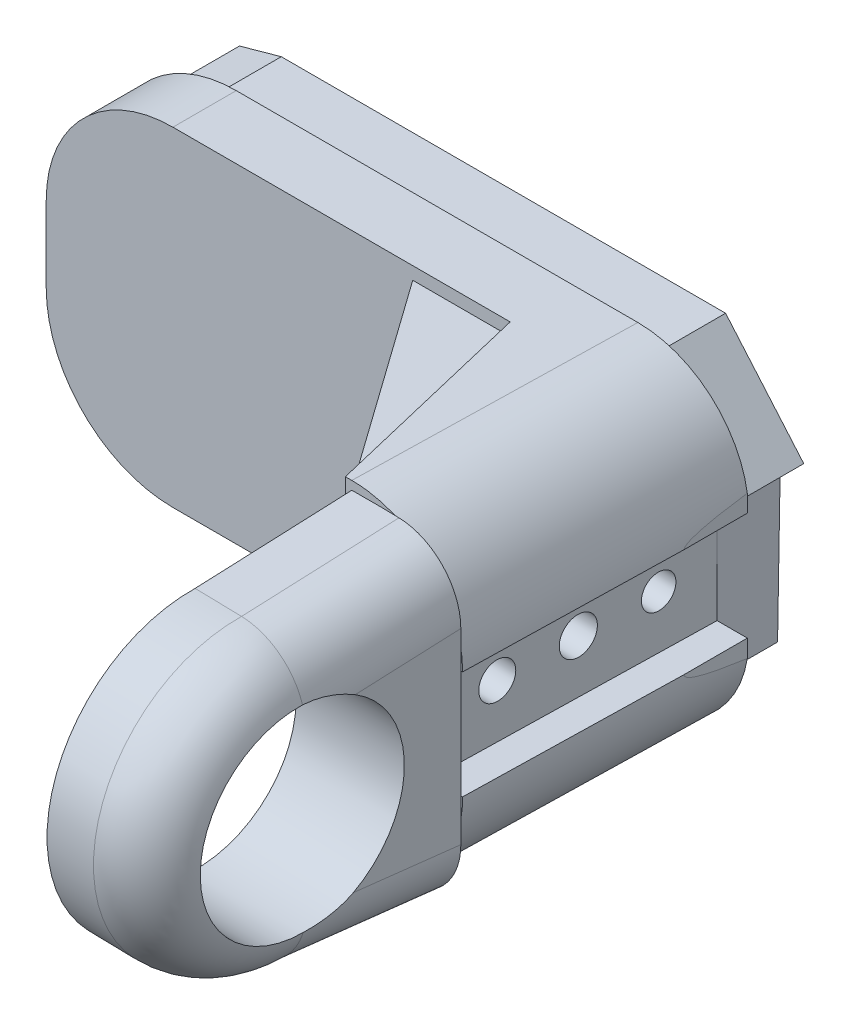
ISO-10303-21;
HEADER;
FILE_DESCRIPTION(('STEP AP214'),'2;1');
FILE_NAME('part.step','',(''),(''),'','','');
FILE_SCHEMA(('AUTOMOTIVE_DESIGN { 1 0 10303 214 1 1 1 1 }'));
ENDSEC;
DATA;
#1=APPLICATION_CONTEXT('core data for automotive mechanical design processes');
#2=APPLICATION_PROTOCOL_DEFINITION('international standard','automotive_design',2000,#1);
#3=PRODUCT_CONTEXT('',#1,'mechanical');
#4=PRODUCT('Part','Part','',(#3));
#5=PRODUCT_RELATED_PRODUCT_CATEGORY('part','',(#4));
#6=PRODUCT_DEFINITION_FORMATION('','',#4);
#7=PRODUCT_DEFINITION_CONTEXT('part definition',#1,'design');
#8=PRODUCT_DEFINITION('design','',#6,#7);
#9=PRODUCT_DEFINITION_SHAPE('','',#8);
#10=(LENGTH_UNIT() NAMED_UNIT(*) SI_UNIT(.MILLI.,.METRE.));
#11=(NAMED_UNIT(*) PLANE_ANGLE_UNIT() SI_UNIT($,.RADIAN.));
#12=(NAMED_UNIT(*) SI_UNIT($,.STERADIAN.) SOLID_ANGLE_UNIT());
#13=UNCERTAINTY_MEASURE_WITH_UNIT(LENGTH_MEASURE(1.E-05),#10,'distance_accuracy_value','');
#14=(GEOMETRIC_REPRESENTATION_CONTEXT(3) GLOBAL_UNCERTAINTY_ASSIGNED_CONTEXT((#13)) GLOBAL_UNIT_ASSIGNED_CONTEXT((#10,
#11,#12)) REPRESENTATION_CONTEXT('',''));
#15=CARTESIAN_POINT('',(0.,0.,0.));
#16=DIRECTION('',(0.,0.,1.));
#17=DIRECTION('',(1.,0.,0.));
#18=AXIS2_PLACEMENT_3D('',#15,#16,#17);
#19=CARTESIAN_POINT('',(1.08583389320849,1.56347900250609,1.18852459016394));
#20=DIRECTION('',(0.,0.,-1.));
#21=DIRECTION('',(-1.,0.,0.));
#22=AXIS2_PLACEMENT_3D('',#19,#20,#21);
#23=CYLINDRICAL_SURFACE('',#22,0.537328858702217);
#24=CARTESIAN_POINT('',(1.08583389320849,1.56347900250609,0.856193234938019));
#25=DIRECTION('',(0.,0.,-1.));
#26=DIRECTION('',(-1.,0.,0.));
#27=AXIS2_PLACEMENT_3D('',#24,#25,#26);
#28=CIRCLE('',#27,0.537328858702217);
#29=CARTESIAN_POINT('',(0.54850503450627,1.56347900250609,0.856193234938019));
#30=VERTEX_POINT('',#29);
#31=EDGE_CURVE('E569',#30,#30,#28,.F.);
#32=ORIENTED_EDGE('',*,*,#31,.T.);
#33=EDGE_LOOP('',(#32));
#34=FACE_BOUND('',#33,.T.);
#35=CARTESIAN_POINT('',(1.08583389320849,1.56347900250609,-0.311475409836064));
#36=DIRECTION('',(0.,0.,-1.));
#37=DIRECTION('',(-1.,0.,0.));
#38=AXIS2_PLACEMENT_3D('',#35,#36,#37);
#39=CIRCLE('',#38,0.537328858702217);
#40=CARTESIAN_POINT('',(0.54850503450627,1.56347900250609,-0.311475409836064));
#41=VERTEX_POINT('',#40);
#42=EDGE_CURVE('E393',#41,#41,#39,.T.);
#43=ORIENTED_EDGE('',*,*,#42,.T.);
#44=EDGE_LOOP('',(#43));
#45=FACE_BOUND('',#44,.T.);
#46=ADVANCED_FACE('F33',(#34,#45),#23,.F.);
#47=CARTESIAN_POINT('',(9.15551433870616,7.2,8.022826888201));
#48=DIRECTION('',(0.,0.,1.));
#49=DIRECTION('',(1.,0.,0.));
#50=AXIS2_PLACEMENT_3D('',#47,#48,#49);
#51=PLANE('',#50);
#52=DIRECTION('',(-1.,0.,0.));
#53=VECTOR('',#52,1.);
#54=CARTESIAN_POINT('',(9.15551433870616,3.71434763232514,8.022826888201));
#55=LINE('',#54,#53);
#56=CARTESIAN_POINT('',(9.15548492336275,3.71434763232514,8.022826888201));
#57=VERTEX_POINT('',#56);
#58=CARTESIAN_POINT('',(8.15526180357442,3.71434763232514,8.022826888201));
#59=VERTEX_POINT('',#58);
#60=EDGE_CURVE('E798',#57,#59,#55,.T.);
#61=ORIENTED_EDGE('',*,*,#60,.F.);
#62=CARTESIAN_POINT('',(5.65463046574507,3.7,8.022826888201));
#63=DIRECTION('',(0.,0.,1.));
#64=DIRECTION('',(-1.,0.,0.));
#65=AXIS2_PLACEMENT_3D('',#62,#63,#64);
#66=ELLIPSE('',#65,3.50088387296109,3.5);
#67=CARTESIAN_POINT('',(5.65463046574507,7.2,8.022826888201));
#68=VERTEX_POINT('',#67);
#69=EDGE_CURVE('E500',#57,#68,#66,.T.);
#70=ORIENTED_EDGE('',*,*,#69,.T.);
#71=DIRECTION('',(-1.,0.,0.));
#72=VECTOR('',#71,1.);
#73=CARTESIAN_POINT('',(9.15551433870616,7.2,8.022826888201));
#74=LINE('',#73,#72);
#75=CARTESIAN_POINT('',(5.45210964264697,7.2,8.022826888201));
#76=VERTEX_POINT('',#75);
#77=EDGE_CURVE('E377',#68,#76,#74,.T.);
#78=ORIENTED_EDGE('',*,*,#77,.T.);
#79=DIRECTION('',(0.,-1.,0.));
#80=VECTOR('',#79,1.);
#81=CARTESIAN_POINT('',(5.45210964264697,7.2,8.022826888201));
#82=LINE('',#81,#80);
#83=CARTESIAN_POINT('',(5.45210964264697,-3.2,8.022826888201));
#84=VERTEX_POINT('',#83);
#85=EDGE_CURVE('E385',#76,#84,#82,.T.);
#86=ORIENTED_EDGE('',*,*,#85,.T.);
#87=DIRECTION('',(-1.,0.,0.));
#88=VECTOR('',#87,1.);
#89=CARTESIAN_POINT('',(9.15551433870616,-3.2,8.022826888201));
#90=LINE('',#89,#88);
#91=CARTESIAN_POINT('',(5.65463046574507,-3.2,8.022826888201));
#92=VERTEX_POINT('',#91);
#93=EDGE_CURVE('E375',#92,#84,#90,.T.);
#94=ORIENTED_EDGE('',*,*,#93,.F.);
#95=CARTESIAN_POINT('',(5.65463046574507,0.299999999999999,8.022826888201));
#96=DIRECTION('',(0.,0.,1.));
#97=DIRECTION('',(1.,0.,0.));
#98=AXIS2_PLACEMENT_3D('',#95,#96,#97);
#99=ELLIPSE('',#98,3.50088387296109,3.5);
#100=CARTESIAN_POINT('',(9.15551357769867,0.297692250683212,8.022826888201));
#101=VERTEX_POINT('',#100);
#102=EDGE_CURVE('E495',#92,#101,#99,.T.);
#103=ORIENTED_EDGE('',*,*,#102,.T.);
#104=DIRECTION('',(1.,0.,0.));
#105=VECTOR('',#104,1.);
#106=CARTESIAN_POINT('',(9.15551433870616,0.297692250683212,8.022826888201));
#107=LINE('',#106,#105);
#108=CARTESIAN_POINT('',(8.15526180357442,0.297692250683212,8.022826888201));
#109=VERTEX_POINT('',#108);
#110=EDGE_CURVE('E792',#109,#101,#107,.T.);
#111=ORIENTED_EDGE('',*,*,#110,.F.);
#112=DIRECTION('',(0.,1.,0.));
#113=VECTOR('',#112,1.);
#114=CARTESIAN_POINT('',(8.15526180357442,7.2,8.022826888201));
#115=LINE('',#114,#113);
#116=EDGE_CURVE('E786',#109,#59,#115,.T.);
#117=ORIENTED_EDGE('',*,*,#116,.T.);
#118=EDGE_LOOP('',(#61,#70,#78,#86,#94,#103,#111,#117));
#119=FACE_BOUND('',#118,.T.);
#120=DIRECTION('',(0.,-1.,0.));
#121=VECTOR('',#120,1.);
#122=CARTESIAN_POINT('',(6.5960428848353,7.2,8.022826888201));
#123=LINE('',#122,#121);
#124=CARTESIAN_POINT('',(6.5960428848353,6.93175560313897,8.022826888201));
#125=VERTEX_POINT('',#124);
#126=CARTESIAN_POINT('',(6.5960428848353,-2.99186036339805,8.022826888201));
#127=VERTEX_POINT('',#126);
#128=EDGE_CURVE('E529',#125,#127,#123,.T.);
#129=ORIENTED_EDGE('',*,*,#128,.T.);
#130=DIRECTION('',(-0.99999778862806,0.00210303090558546,0.));
#131=VECTOR('',#130,1.);
#132=CARTESIAN_POINT('',(9.13406926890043,-2.99719792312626,8.022826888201));
#133=LINE('',#132,#131);
#134=CARTESIAN_POINT('',(5.65463046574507,-2.98988053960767,8.022826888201));
#135=VERTEX_POINT('',#134);
#136=EDGE_CURVE('E532',#127,#135,#133,.T.);
#137=ORIENTED_EDGE('',*,*,#136,.T.);
#138=DIRECTION('',(0.,1.,0.));
#139=VECTOR('',#138,1.);
#140=CARTESIAN_POINT('',(5.65463046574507,7.2,8.022826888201));
#141=LINE('',#140,#139);
#142=CARTESIAN_POINT('',(5.65463046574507,6.93036306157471,8.022826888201));
#143=VERTEX_POINT('',#142);
#144=EDGE_CURVE('E523',#135,#143,#141,.T.);
#145=ORIENTED_EDGE('',*,*,#144,.T.);
#146=DIRECTION('',(0.999998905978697,0.00147920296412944,0.));
#147=VECTOR('',#146,1.);
#148=CARTESIAN_POINT('',(9.15590552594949,6.93554216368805,8.022826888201));
#149=LINE('',#148,#147);
#150=EDGE_CURVE('E526',#143,#125,#149,.T.);
#151=ORIENTED_EDGE('',*,*,#150,.T.);
#152=EDGE_LOOP('',(#129,#137,#145,#151));
#153=FACE_BOUND('',#152,.T.);
#154=ADVANCED_FACE('F849',(#119,#153),#51,.T.);
#155=CARTESIAN_POINT('',(-10.8286554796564,-3.2,-0.811475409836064));
#156=DIRECTION('',(0.,0.,-1.));
#157=DIRECTION('',(-1.,0.,0.));
#158=AXIS2_PLACEMENT_3D('',#155,#156,#157);
#159=PLANE('',#158);
#160=DIRECTION('',(-0.934571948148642,-0.355774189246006,0.));
#161=VECTOR('',#160,1.);
#162=CARTESIAN_POINT('',(-4.71391099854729,-1.6403096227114,-0.811475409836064));
#163=LINE('',#162,#161);
#164=CARTESIAN_POINT('',(-3.26153256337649,-1.08741611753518,-0.811475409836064));
#165=VERTEX_POINT('',#164);
#166=CARTESIAN_POINT('',(-4.71391099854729,-1.6403096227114,-0.811475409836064));
#167=VERTEX_POINT('',#166);
#168=EDGE_CURVE('E423',#165,#167,#163,.T.);
#169=ORIENTED_EDGE('',*,*,#168,.F.);
#170=CARTESIAN_POINT('',(-5.84760239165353,1.59946844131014,-0.811475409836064));
#171=DIRECTION('',(0.,0.,-1.));
#172=DIRECTION('',(-1.,0.,0.));
#173=AXIS2_PLACEMENT_3D('',#170,#171,#172);
#174=CIRCLE('',#173,3.72922321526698);
#175=CARTESIAN_POINT('',(-2.51168568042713,3.26643139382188,-0.811475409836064));
#176=VERTEX_POINT('',#175);
#177=EDGE_CURVE('E636',#165,#176,#174,.T.);
#178=ORIENTED_EDGE('',*,*,#177,.T.);
#179=DIRECTION('',(0.999985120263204,-0.00545520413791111,0.));
#180=VECTOR('',#179,1.);
#181=CARTESIAN_POINT('',(6.77880972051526,3.21574909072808,-0.811475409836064));
#182=LINE('',#181,#180);
#183=CARTESIAN_POINT('',(-2.92561851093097,3.26868951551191,-0.811475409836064));
#184=VERTEX_POINT('',#183);
#185=EDGE_CURVE('E398',#184,#176,#182,.T.);
#186=ORIENTED_EDGE('',*,*,#185,.F.);
#187=CARTESIAN_POINT('',(-5.94269726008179,1.58755008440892,-0.811475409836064));
#188=DIRECTION('',(0.,0.,-1.));
#189=DIRECTION('',(-1.,0.,0.));
#190=AXIS2_PLACEMENT_3D('',#187,#188,#189);
#191=CIRCLE('',#190,3.453837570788);
#192=EDGE_CURVE('E425',#167,#184,#191,.T.);
#193=ORIENTED_EDGE('',*,*,#192,.F.);
#194=EDGE_LOOP('',(#169,#178,#186,#193));
#195=FACE_BOUND('',#194,.T.);
#196=ADVANCED_FACE('F851',(#195),#159,.T.);
#197=CARTESIAN_POINT('',(9.30911656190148,-3.2,-0.811475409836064));
#198=DIRECTION('',(1.,0.,0.));
#199=DIRECTION('',(0.,0.,-1.));
#200=AXIS2_PLACEMENT_3D('',#197,#198,#199);
#201=PLANE('',#200);
#202=DIRECTION('',(0.,0.,1.));
#203=VECTOR('',#202,1.);
#204=CARTESIAN_POINT('',(9.30911656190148,3.71434763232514,-0.811475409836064));
#205=LINE('',#204,#203);
#206=CARTESIAN_POINT('',(9.30911656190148,3.71434763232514,-0.811475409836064));
#207=VERTEX_POINT('',#206);
#208=CARTESIAN_POINT('',(9.30911656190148,3.71434763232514,1.1872157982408));
#209=VERTEX_POINT('',#208);
#210=EDGE_CURVE('E800',#207,#209,#205,.T.);
#211=ORIENTED_EDGE('',*,*,#210,.F.);
#212=DIRECTION('',(0.,1.,0.));
#213=VECTOR('',#212,1.);
#214=CARTESIAN_POINT('',(9.30911656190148,-3.2,-0.811475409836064));
#215=LINE('',#214,#213);
#216=CARTESIAN_POINT('',(9.30911656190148,4.25906499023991,-0.811475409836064));
#217=VERTEX_POINT('',#216);
#218=EDGE_CURVE('E466',#207,#217,#215,.T.);
#219=ORIENTED_EDGE('',*,*,#218,.T.);
#220=CARTESIAN_POINT('',(9.30911656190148,3.7,-154.578092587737));
#221=DIRECTION('',(1.,0.,0.));
#222=DIRECTION('',(0.,0.,1.));
#223=AXIS2_PLACEMENT_3D('',#220,#221,#222);
#224=ELLIPSE('',#223,155.766617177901,3.5);
#225=EDGE_CURVE('E511',#217,#209,#224,.T.);
#226=ORIENTED_EDGE('',*,*,#225,.T.);
#227=EDGE_LOOP('',(#211,#219,#226));
#228=FACE_BOUND('',#227,.T.);
#229=ADVANCED_FACE('F827',(#228),#201,.T.);
#230=CARTESIAN_POINT('',(9.46653395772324,1.97742552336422,1.01877416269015));
#231=DIRECTION('',(-0.99974752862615,0.,-0.0224695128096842));
#232=DIRECTION('',(-0.0224695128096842,0.,0.99974752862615));
#233=AXIS2_PLACEMENT_3D('',#230,#231,#232);
#234=CYLINDRICAL_SURFACE('',#233,0.532502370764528);
#235=CARTESIAN_POINT('',(5.50976629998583,1.56347900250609,1.26490287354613));
#236=CARTESIAN_POINT('',(5.50976572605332,1.54477780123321,1.24178457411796));
#237=CARTESIAN_POINT('',(5.51075346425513,1.52799735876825,1.21709096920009));
#238=CARTESIAN_POINT('',(5.51352427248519,1.49878793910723,1.16526389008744));
#239=CARTESIAN_POINT('',(5.51530869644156,1.4863664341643,1.1381263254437));
#240=CARTESIAN_POINT('',(5.51866548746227,1.46623657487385,1.08216537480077));
#241=CARTESIAN_POINT('',(5.52023804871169,1.45852388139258,1.05334356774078));
#242=CARTESIAN_POINT('',(5.52246866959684,1.44802686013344,0.994801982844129));
#243=CARTESIAN_POINT('',(5.52312749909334,1.4452383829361,0.965082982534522));
#244=CARTESIAN_POINT('',(5.52326027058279,1.44466053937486,0.905801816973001));
#245=CARTESIAN_POINT('',(5.5227424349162,1.44683648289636,0.8762400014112));
#246=CARTESIAN_POINT('',(5.52075387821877,1.4560330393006,0.817904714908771));
#247=CARTESIAN_POINT('',(5.51928271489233,1.46305590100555,0.789131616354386));
#248=CARTESIAN_POINT('',(5.51602277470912,1.48174536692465,0.733137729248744));
#249=CARTESIAN_POINT('',(5.5142337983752,1.49341489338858,0.705917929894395));
#250=CARTESIAN_POINT('',(5.5112788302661,1.52112150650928,0.653736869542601));
#251=CARTESIAN_POINT('',(5.51011311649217,1.53716053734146,0.628776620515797));
#252=CARTESIAN_POINT('',(5.50954678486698,1.57337146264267,0.581629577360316));
#253=CARTESIAN_POINT('',(5.51016262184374,1.59358027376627,0.559470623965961));
#254=CARTESIAN_POINT('',(5.5144770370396,1.63729159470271,0.51905493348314));
#255=CARTESIAN_POINT('',(5.51816955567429,1.66078755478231,0.500790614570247));
#256=CARTESIAN_POINT('',(5.52894619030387,1.7064048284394,0.471089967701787));
#257=CARTESIAN_POINT('',(5.53548924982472,1.72826525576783,0.459058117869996));
#258=CARTESIAN_POINT('',(5.55210182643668,1.77234316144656,0.438643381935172));
#259=CARTESIAN_POINT('',(5.56216899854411,1.79456039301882,0.430258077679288));
#260=CARTESIAN_POINT('',(5.58427460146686,1.83527449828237,0.417825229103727));
#261=CARTESIAN_POINT('',(5.59588507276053,1.8538788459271,0.4133547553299));
#262=CARTESIAN_POINT('',(5.62155299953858,1.88975112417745,0.406670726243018));
#263=CARTESIAN_POINT('',(5.63561105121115,1.90701872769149,0.404457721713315));
#264=CARTESIAN_POINT('',(5.66666871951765,1.94058077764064,0.40172865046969));
#265=CARTESIAN_POINT('',(5.68378529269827,1.95677408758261,0.401309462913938));
#266=CARTESIAN_POINT('',(5.72000266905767,1.98673649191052,0.401803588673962));
#267=CARTESIAN_POINT('',(5.7391045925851,2.00050420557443,0.4027176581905));
#268=CARTESIAN_POINT('',(5.78211069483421,2.02735341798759,0.405478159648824));
#269=CARTESIAN_POINT('',(5.80629477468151,2.03997481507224,0.407450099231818));
#270=CARTESIAN_POINT('',(5.85630458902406,2.06136167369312,0.411544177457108));
#271=CARTESIAN_POINT('',(5.88213106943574,2.07012536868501,0.413666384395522));
#272=CARTESIAN_POINT('',(5.93736785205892,2.08423202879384,0.417587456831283));
#273=CARTESIAN_POINT('',(5.96688594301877,2.08917251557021,0.41933667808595));
#274=CARTESIAN_POINT('',(6.02637150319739,2.09401544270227,0.421736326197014));
#275=CARTESIAN_POINT('',(6.05633886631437,2.09391905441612,0.422387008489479));
#276=CARTESIAN_POINT('',(6.11525645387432,2.08873394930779,0.422576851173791));
#277=CARTESIAN_POINT('',(6.14421515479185,2.08374132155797,0.422137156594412));
#278=CARTESIAN_POINT('',(6.20090634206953,2.06905018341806,0.420632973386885));
#279=CARTESIAN_POINT('',(6.228638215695,2.05934934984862,0.419568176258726));
#280=CARTESIAN_POINT('',(6.28241490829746,2.03537454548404,0.417597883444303));
#281=CARTESIAN_POINT('',(6.30843853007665,2.02105280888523,0.416694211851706));
#282=CARTESIAN_POINT('',(6.3577500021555,1.98824882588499,0.416124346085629));
#283=CARTESIAN_POINT('',(6.38103810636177,1.96976696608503,0.416458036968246));
#284=CARTESIAN_POINT('',(6.42370013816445,1.92965237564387,0.419525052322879));
#285=CARTESIAN_POINT('',(6.44314315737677,1.90809021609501,0.422210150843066));
#286=CARTESIAN_POINT('',(6.47796526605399,1.86253352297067,0.431003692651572));
#287=CARTESIAN_POINT('',(6.49335145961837,1.83854334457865,0.43710609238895));
#288=CARTESIAN_POINT('',(6.51776059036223,1.79307381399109,0.452313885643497));
#289=CARTESIAN_POINT('',(6.52737923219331,1.77172685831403,0.460864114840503));
#290=CARTESIAN_POINT('',(6.54336765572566,1.72935341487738,0.481186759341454));
#291=CARTESIAN_POINT('',(6.54973770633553,1.70832690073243,0.492958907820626));
#292=CARTESIAN_POINT('',(6.55922597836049,1.66908266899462,0.518591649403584));
#293=CARTESIAN_POINT('',(6.56254729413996,1.65077192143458,0.532237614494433));
#294=CARTESIAN_POINT('',(6.56718685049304,1.61589129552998,0.56188134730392));
#295=CARTESIAN_POINT('',(6.56850454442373,1.59932189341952,0.577879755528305));
#296=CARTESIAN_POINT('',(6.56975331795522,1.56686956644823,0.613527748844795));
#297=CARTESIAN_POINT('',(6.56953929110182,1.55120488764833,0.633380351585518));
#298=CARTESIAN_POINT('',(6.56812248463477,1.52284637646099,0.675076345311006));
#299=CARTESIAN_POINT('',(6.56691902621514,1.51015459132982,0.696921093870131));
#300=CARTESIAN_POINT('',(6.56401362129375,1.48641607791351,0.745405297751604));
#301=CARTESIAN_POINT('',(6.56226507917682,1.47586145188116,0.772284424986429));
#302=CARTESIAN_POINT('',(6.55920595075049,1.45923806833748,0.827418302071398));
#303=CARTESIAN_POINT('',(6.55789535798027,1.45316924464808,0.855673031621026));
#304=CARTESIAN_POINT('',(6.55621854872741,1.44555421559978,0.913833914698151));
#305=CARTESIAN_POINT('',(6.55588716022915,1.44417454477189,0.943763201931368));
#306=CARTESIAN_POINT('',(6.55640495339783,1.44644006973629,1.0034187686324));
#307=CARTESIAN_POINT('',(6.55725419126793,1.45008550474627,1.03314503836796));
#308=CARTESIAN_POINT('',(6.55974864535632,1.46215553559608,1.09099604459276));
#309=CARTESIAN_POINT('',(6.56137892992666,1.47049097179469,1.11914018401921));
#310=CARTESIAN_POINT('',(6.56471002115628,1.49165612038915,1.17370488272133));
#311=CARTESIAN_POINT('',(6.56641088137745,1.50448930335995,1.20012409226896));
#312=CARTESIAN_POINT('',(6.56893740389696,1.53476944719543,1.25124806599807));
#313=CARTESIAN_POINT('',(6.56973712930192,1.55233592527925,1.27588379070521));
#314=CARTESIAN_POINT('',(6.56911340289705,1.59139556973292,1.32177224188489));
#315=CARTESIAN_POINT('',(6.56769400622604,1.6128815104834,1.34303106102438));
#316=CARTESIAN_POINT('',(6.56210383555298,1.65341100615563,1.37680248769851));
#317=CARTESIAN_POINT('',(6.55866551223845,1.67182509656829,1.39019360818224));
#318=CARTESIAN_POINT('',(6.54926975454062,1.70977140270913,1.41422064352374));
#319=CARTESIAN_POINT('',(6.54331450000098,1.72930263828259,1.4248589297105));
#320=CARTESIAN_POINT('',(6.52858123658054,1.76871871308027,1.44325220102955));
#321=CARTESIAN_POINT('',(6.51979695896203,1.7886042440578,1.45100069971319));
#322=CARTESIAN_POINT('',(6.49938374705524,1.82780549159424,1.46368520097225));
#323=CARTESIAN_POINT('',(6.48775386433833,1.84712101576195,1.46862026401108));
#324=CARTESIAN_POINT('',(6.46223013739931,1.88386869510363,1.47593159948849));
#325=CARTESIAN_POINT('',(6.44840940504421,1.90133860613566,1.47837612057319));
#326=CARTESIAN_POINT('',(6.41859012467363,1.93447833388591,1.48143514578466));
#327=CARTESIAN_POINT('',(6.402590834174,1.95014753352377,1.48204902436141));
#328=CARTESIAN_POINT('',(6.36673060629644,1.98107238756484,1.48198082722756));
#329=CARTESIAN_POINT('',(6.3466366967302,1.99605677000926,1.48113578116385));
#330=CARTESIAN_POINT('',(6.30457554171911,2.02302571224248,1.47856117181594));
#331=CARTESIAN_POINT('',(6.28260695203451,2.03500809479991,1.4768309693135));
#332=CARTESIAN_POINT('',(6.23376311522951,2.05733322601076,1.47286145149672));
#333=CARTESIAN_POINT('',(6.20664922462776,2.06715108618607,1.47058472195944));
#334=CARTESIAN_POINT('',(6.15115554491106,2.08226936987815,1.46652838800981));
#335=CARTESIAN_POINT('',(6.12277578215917,2.08756988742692,1.46474877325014));
#336=CARTESIAN_POINT('',(6.0645199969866,2.09359232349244,1.46213157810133));
#337=CARTESIAN_POINT('',(6.03462569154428,2.09415500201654,1.46132753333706));
#338=CARTESIAN_POINT('',(5.97515959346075,2.09024867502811,1.46085283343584));
#339=CARTESIAN_POINT('',(5.9455878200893,2.0857793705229,1.46118224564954));
#340=CARTESIAN_POINT('',(5.88822912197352,2.07208933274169,1.46254858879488));
#341=CARTESIAN_POINT('',(5.8604180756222,2.06296753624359,1.46357092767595));
#342=CARTESIAN_POINT('',(5.80665564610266,2.04027012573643,1.46555590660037));
#343=CARTESIAN_POINT('',(5.7807053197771,2.02669200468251,1.46651851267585));
#344=CARTESIAN_POINT('',(5.730822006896,1.99508449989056,1.46739761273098));
#345=CARTESIAN_POINT('',(5.70694647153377,1.97696313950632,1.46729045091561));
#346=CARTESIAN_POINT('',(5.6626606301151,1.93702313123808,1.46475688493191));
#347=CARTESIAN_POINT('',(5.64224642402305,1.91520870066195,1.46233311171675));
#348=CARTESIAN_POINT('',(5.60715416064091,1.87080976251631,1.45432810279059));
#349=CARTESIAN_POINT('',(5.59213870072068,1.84844311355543,1.44902859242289));
#350=CARTESIAN_POINT('',(5.56605806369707,1.80259896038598,1.43478810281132));
#351=CARTESIAN_POINT('',(5.55498874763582,1.77912264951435,1.425850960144));
#352=CARTESIAN_POINT('',(5.53808452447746,1.73573883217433,1.40561150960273));
#353=CARTESIAN_POINT('',(5.53173368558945,1.71579193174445,1.39481565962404));
#354=CARTESIAN_POINT('',(5.52167350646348,1.6769630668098,1.37045429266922));
#355=CARTESIAN_POINT('',(5.51796348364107,1.65808082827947,1.35688949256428));
#356=CARTESIAN_POINT('',(5.51329124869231,1.62611343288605,1.33060680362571));
#357=CARTESIAN_POINT('',(5.51189930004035,1.61267810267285,1.31838167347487));
#358=CARTESIAN_POINT('',(5.51013695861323,1.58708177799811,1.29260195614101));
#359=CARTESIAN_POINT('',(5.50976665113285,1.57492089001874,1.27904725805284));
#360=CARTESIAN_POINT('',(5.50976629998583,1.56347900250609,1.26490287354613));
#361=B_SPLINE_CURVE_WITH_KNOTS('',3,(#235,#236,#237,#238,#239,#240,#241,#242,#243,#244,#245,
#246,#247,#248,#249,#250,#251,#252,#253,#254,#255,#256,#257,#258,#259,#260,#261,#262,#263,#264,
#265,#266,#267,#268,#269,#270,#271,#272,#273,#274,#275,#276,#277,#278,#279,#280,#281,#282,#283,
#284,#285,#286,#287,#288,#289,#290,#291,#292,#293,#294,#295,#296,#297,#298,#299,#300,#301,#302,
#303,#304,#305,#306,#307,#308,#309,#310,#311,#312,#313,#314,#315,#316,#317,#318,#319,#320,#321,
#322,#323,#324,#325,#326,#327,#328,#329,#330,#331,#332,#333,#334,#335,#336,#337,#338,#339,#340,
#341,#342,#343,#344,#345,#346,#347,#348,#349,#350,#351,#352,#353,#354,#355,#356,#357,#358,#359,
#360),.UNSPECIFIED.,.T.,.F.,(4,2,2,2,2,2,2,2,2,2,2,2,2,2,2,2,2,2,2,2,2,2,2,2,2,2,2,2,2,2,2,2,2,
2,2,2,2,2,2,2,2,2,2,2,2,2,2,2,2,2,2,2,2,2,2,2,2,2,2,2,2,2,4),(0.,0.0891358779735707,
0.178423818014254,0.267629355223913,0.35675968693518,0.445269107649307,0.533819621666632,
0.62242591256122,0.7110716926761,0.800538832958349,0.889830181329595,0.966744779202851,
1.04360829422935,1.11045342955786,1.17731487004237,1.247745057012,1.318215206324,
1.39993084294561,1.48168386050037,1.57117794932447,1.66065122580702,1.74840301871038,
1.83619815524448,1.92493157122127,2.01365674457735,2.10060374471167,2.18739746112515,
2.26176234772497,2.33612107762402,2.40506260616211,2.47402294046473,2.54959705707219,
2.62522306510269,2.71162519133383,2.79802604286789,2.88746504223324,2.9769082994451,
3.06470600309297,3.15257160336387,3.24290630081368,3.33307611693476,3.40185861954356,
3.47058167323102,3.53945806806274,3.60835745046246,3.6753134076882,3.74229224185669,
3.81724428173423,3.89225052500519,3.97864099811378,4.06502967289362,4.15431076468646,
4.24359716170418,4.3310594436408,4.41857101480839,4.50802194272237,4.59737140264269,
4.67923064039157,4.76100376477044,4.83132585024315,4.90162975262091,4.9561608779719,
5.01069655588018),.UNSPECIFIED.);
#362=CARTESIAN_POINT('',(5.51739455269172,1.47389294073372,1.10330492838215));
#363=VERTEX_POINT('',#362);
#364=CARTESIAN_POINT('',(6.56186338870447,1.47389294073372,1.12677956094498));
#365=VERTEX_POINT('',#364);
#366=EDGE_CURVE('E381',#363,#365,#361,.T.);
#367=ORIENTED_EDGE('',*,*,#366,.T.);
#368=DIRECTION('',(-0.99974752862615,0.,-0.0224695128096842));
#369=VECTOR('',#368,1.);
#370=CARTESIAN_POINT('',(9.46264123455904,1.47389294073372,1.19197508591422));
#371=LINE('',#370,#369);
#372=EDGE_CURVE('E810',#363,#365,#371,.F.);
#373=ORIENTED_EDGE('',*,*,#372,.F.);
#374=EDGE_LOOP('',(#367,#373));
#375=FACE_BOUND('',#374,.T.);
#376=CARTESIAN_POINT('',(5.31401917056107,1.97742552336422,0.925445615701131));
#377=DIRECTION('',(0.99974752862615,0.,0.0224695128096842));
#378=DIRECTION('',(0.0224695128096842,0.,-0.99974752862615));
#379=AXIS2_PLACEMENT_3D('',#376,#377,#378);
#380=CIRCLE('',#379,0.532502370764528);
#381=CARTESIAN_POINT('',(5.32598423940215,1.97742552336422,0.393077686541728));
#382=VERTEX_POINT('',#381);
#383=EDGE_CURVE('E804',#382,#382,#380,.T.);
#384=ORIENTED_EDGE('',*,*,#383,.F.);
#385=EDGE_LOOP('',(#384));
#386=FACE_BOUND('',#385,.T.);
#387=CARTESIAN_POINT('',(8.31326175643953,1.97742552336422,0.992854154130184));
#388=DIRECTION('',(0.99974752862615,0.,0.0224695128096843));
#389=DIRECTION('',(0.0224695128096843,0.,-0.99974752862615));
#390=AXIS2_PLACEMENT_3D('',#387,#388,#389);
#391=CIRCLE('',#390,0.532502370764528);
#392=CARTESIAN_POINT('',(8.32522682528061,1.97742552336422,0.46048622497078));
#393=VERTEX_POINT('',#392);
#394=EDGE_CURVE('E520',#393,#393,#391,.T.);
#395=ORIENTED_EDGE('',*,*,#394,.T.);
#396=EDGE_LOOP('',(#395));
#397=FACE_BOUND('',#396,.T.);
#398=ADVANCED_FACE('F822',(#375,#386,#397),#234,.F.);
#399=CARTESIAN_POINT('',(6.0396289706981,1.56347900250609,1.18852459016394));
#400=DIRECTION('',(0.,0.,-1.));
#401=DIRECTION('',(-1.,0.,0.));
#402=AXIS2_PLACEMENT_3D('',#399,#400,#401);
#403=CYLINDRICAL_SURFACE('',#402,0.529862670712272);
#404=CARTESIAN_POINT('',(6.0396289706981,1.56347900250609,-0.311475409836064));
#405=DIRECTION('',(0.,0.,-1.));
#406=DIRECTION('',(-1.,0.,0.));
#407=AXIS2_PLACEMENT_3D('',#404,#405,#406);
#408=CIRCLE('',#407,0.529862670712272);
#409=CARTESIAN_POINT('',(5.50976629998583,1.56347900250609,-0.311475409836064));
#410=VERTEX_POINT('',#409);
#411=EDGE_CURVE('E426',#410,#410,#408,.T.);
#412=ORIENTED_EDGE('',*,*,#411,.T.);
#413=EDGE_LOOP('',(#412));
#414=FACE_BOUND('',#413,.T.);
#415=ORIENTED_EDGE('',*,*,#366,.F.);
#416=CARTESIAN_POINT('',(6.0396289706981,1.56347900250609,1.11504224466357));
#417=DIRECTION('',(0.0224695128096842,0.,-0.99974752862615));
#418=DIRECTION('',(-0.99974752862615,0.,-0.0224695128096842));
#419=AXIS2_PLACEMENT_3D('',#416,#417,#418);
#420=ELLIPSE('',#419,0.529996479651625,0.529862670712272);
#421=EDGE_CURVE('E387',#363,#365,#420,.F.);
#422=ORIENTED_EDGE('',*,*,#421,.T.);
#423=EDGE_LOOP('',(#415,#422));
#424=FACE_BOUND('',#423,.T.);
#425=ADVANCED_FACE('F818',(#414,#424),#403,.F.);
#426=CARTESIAN_POINT('',(3.79092736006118,7.2,1.06450225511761));
#427=DIRECTION('',(0.0224695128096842,0.,-0.99974752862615));
#428=DIRECTION('',(-0.99974752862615,0.,-0.0224695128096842));
#429=AXIS2_PLACEMENT_3D('',#426,#427,#428);
#430=PLANE('',#429);
#431=ORIENTED_EDGE('',*,*,#421,.F.);
#432=ORIENTED_EDGE('',*,*,#372,.T.);
#433=EDGE_LOOP('',(#431,#432));
#434=FACE_BOUND('',#433,.T.);
#435=ADVANCED_FACE('F853',(#434),#430,.T.);
#436=CARTESIAN_POINT('',(-10.8286554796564,-3.2,-0.811475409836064));
#437=DIRECTION('',(-1.,0.,0.));
#438=DIRECTION('',(0.,0.,1.));
#439=AXIS2_PLACEMENT_3D('',#436,#437,#438);
#440=PLANE('',#439);
#441=DIRECTION('',(0.,1.,0.));
#442=VECTOR('',#441,1.);
#443=CARTESIAN_POINT('',(-10.8286554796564,-3.2,1.18852459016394));
#444=LINE('',#443,#442);
#445=CARTESIAN_POINT('',(-10.8286554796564,0.799999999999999,1.18852459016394));
#446=VERTEX_POINT('',#445);
#447=CARTESIAN_POINT('',(-10.8286554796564,3.2,1.18852459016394));
#448=VERTEX_POINT('',#447);
#449=EDGE_CURVE('E458',#446,#448,#444,.T.);
#450=ORIENTED_EDGE('',*,*,#449,.T.);
#451=DIRECTION('',(0.,0.,1.));
#452=VECTOR('',#451,1.);
#453=CARTESIAN_POINT('',(-10.8286554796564,3.2,-0.811475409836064));
#454=LINE('',#453,#452);
#455=CARTESIAN_POINT('',(-10.8286554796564,3.2,-0.811475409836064));
#456=VERTEX_POINT('',#455);
#457=EDGE_CURVE('E485',#448,#456,#454,.F.);
#458=ORIENTED_EDGE('',*,*,#457,.T.);
#459=DIRECTION('',(0.,1.,0.));
#460=VECTOR('',#459,1.);
#461=CARTESIAN_POINT('',(-10.8286554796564,-3.2,-0.811475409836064));
#462=LINE('',#461,#460);
#463=CARTESIAN_POINT('',(-10.8286554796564,0.799999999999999,-0.811475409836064));
#464=VERTEX_POINT('',#463);
#465=EDGE_CURVE('E459',#464,#456,#462,.T.);
#466=ORIENTED_EDGE('',*,*,#465,.F.);
#467=DIRECTION('',(0.,0.,1.));
#468=VECTOR('',#467,1.);
#469=CARTESIAN_POINT('',(-10.8286554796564,0.799999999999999,1.18852459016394));
#470=LINE('',#469,#468);
#471=EDGE_CURVE('E482',#464,#446,#470,.T.);
#472=ORIENTED_EDGE('',*,*,#471,.T.);
#473=EDGE_LOOP('',(#450,#458,#466,#472));
#474=FACE_BOUND('',#473,.T.);
#475=ADVANCED_FACE('F855',(#474),#440,.T.);
#476=DIRECTION('',(-0.990721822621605,-0.135905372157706,0.));
#477=VECTOR('',#476,1.);
#478=CARTESIAN_POINT('',(8.35381440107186,3.85821182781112,-0.811475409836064));
#479=LINE('',#478,#477);
#480=CARTESIAN_POINT('',(9.09114222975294,3.95935708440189,-0.811475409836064));
#481=VERTEX_POINT('',#480);
#482=CARTESIAN_POINT('',(8.35381440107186,3.85821182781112,-0.811475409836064));
#483=VERTEX_POINT('',#482);
#484=EDGE_CURVE('E669',#481,#483,#479,.T.);
#485=ORIENTED_EDGE('',*,*,#484,.F.);
#486=DIRECTION('',(0.650791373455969,-0.759256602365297,0.));
#487=VECTOR('',#486,1.);
#488=CARTESIAN_POINT('',(9.09114222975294,3.95935708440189,-0.811475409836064));
#489=LINE('',#488,#487);
#490=CARTESIAN_POINT('',(6.62300181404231,6.83885423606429,-0.811475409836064));
#491=VERTEX_POINT('',#490);
#492=EDGE_CURVE('E674',#491,#481,#489,.T.);
#493=ORIENTED_EDGE('',*,*,#492,.F.);
#494=DIRECTION('',(1.,0.,0.));
#495=VECTOR('',#494,1.);
#496=CARTESIAN_POINT('',(6.62300181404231,6.83885423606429,-0.811475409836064));
#497=LINE('',#496,#495);
#498=CARTESIAN_POINT('',(-7.40642791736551,6.83885423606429,-0.811475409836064));
#499=VERTEX_POINT('',#498);
#500=EDGE_CURVE('E731',#499,#491,#497,.T.);
#501=ORIENTED_EDGE('',*,*,#500,.F.);
#502=DIRECTION('',(0.96329132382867,0.268458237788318,0.));
#503=VECTOR('',#502,1.);
#504=CARTESIAN_POINT('',(-7.40642791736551,6.83885423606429,-0.811475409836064));
#505=LINE('',#504,#503);
#506=CARTESIAN_POINT('',(-8.72709954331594,6.47079820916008,-0.811475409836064));
#507=VERTEX_POINT('',#506);
#508=EDGE_CURVE('E728',#507,#499,#505,.T.);
#509=ORIENTED_EDGE('',*,*,#508,.F.);
#510=DIRECTION('',(0.68331814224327,0.730120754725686,0.));
#511=VECTOR('',#510,1.);
#512=CARTESIAN_POINT('',(-8.72709954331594,6.47079820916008,-0.811475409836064));
#513=LINE('',#512,#511);
#514=CARTESIAN_POINT('',(-10.3075754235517,4.78207055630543,-0.811475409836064));
#515=VERTEX_POINT('',#514);
#516=EDGE_CURVE('E725',#515,#507,#513,.T.);
#517=ORIENTED_EDGE('',*,*,#516,.F.);
#518=DIRECTION('',(0.170541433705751,0.985350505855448,0.));
#519=VECTOR('',#518,1.);
#520=CARTESIAN_POINT('',(-10.3075754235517,4.78207055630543,-0.811475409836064));
#521=LINE('',#520,#519);
#522=CARTESIAN_POINT('',(-10.6972818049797,2.53043368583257,-0.811475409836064));
#523=VERTEX_POINT('',#522);
#524=EDGE_CURVE('E722',#523,#515,#521,.T.);
#525=ORIENTED_EDGE('',*,*,#524,.F.);
#526=DIRECTION('',(-0.0439166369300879,0.999035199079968,0.));
#527=VECTOR('',#526,1.);
#528=CARTESIAN_POINT('',(-10.6972818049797,2.53043368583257,-0.811475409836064));
#529=LINE('',#528,#527);
#530=CARTESIAN_POINT('',(-10.6034788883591,0.396563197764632,-0.811475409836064));
#531=VERTEX_POINT('',#530);
#532=EDGE_CURVE('E719',#531,#523,#529,.T.);
#533=ORIENTED_EDGE('',*,*,#532,.F.);
#534=DIRECTION('',(-0.268458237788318,0.96329132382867,0.));
#535=VECTOR('',#534,1.);
#536=CARTESIAN_POINT('',(-10.6034788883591,0.396563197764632,-0.811475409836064));
#537=LINE('',#536,#535);
#538=CARTESIAN_POINT('',(-10.2538587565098,-0.857956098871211,-0.811475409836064));
#539=VERTEX_POINT('',#538);
#540=EDGE_CURVE('E716',#539,#531,#537,.T.);
#541=ORIENTED_EDGE('',*,*,#540,.F.);
#542=DIRECTION('',(-0.697992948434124,0.716104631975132,0.));
#543=VECTOR('',#542,1.);
#544=CARTESIAN_POINT('',(-10.2538587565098,-0.857956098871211,-0.811475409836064));
#545=LINE('',#544,#543);
#546=CARTESIAN_POINT('',(-8.72709954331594,-2.4243320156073,-0.811475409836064));
#547=VERTEX_POINT('',#546);
#548=EDGE_CURVE('E713',#547,#539,#545,.T.);
#549=ORIENTED_EDGE('',*,*,#548,.F.);
#550=DIRECTION('',(-0.956578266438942,0.291475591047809,0.));
#551=VECTOR('',#550,1.);
#552=CARTESIAN_POINT('',(-8.72709954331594,-2.4243320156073,-0.811475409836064));
#553=LINE('',#552,#551);
#554=CARTESIAN_POINT('',(-7.64760929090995,-2.7532596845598,-0.811475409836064));
#555=VERTEX_POINT('',#554);
#556=EDGE_CURVE('E710',#555,#547,#553,.T.);
#557=ORIENTED_EDGE('',*,*,#556,.F.);
#558=DIRECTION('',(-1.,0.,0.));
#559=VECTOR('',#558,1.);
#560=CARTESIAN_POINT('',(-7.64760929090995,-2.7532596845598,-0.811475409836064));
#561=LINE('',#560,#559);
#562=CARTESIAN_POINT('',(5.85318306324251,-2.7532596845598,-0.811475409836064));
#563=VERTEX_POINT('',#562);
#564=EDGE_CURVE('E707',#563,#555,#561,.T.);
#565=ORIENTED_EDGE('',*,*,#564,.F.);
#566=DIRECTION('',(-0.861529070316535,-0.507708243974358,0.));
#567=VECTOR('',#566,1.);
#568=CARTESIAN_POINT('',(5.85318306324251,-2.7532596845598,-0.811475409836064));
#569=LINE('',#568,#567);
#570=CARTESIAN_POINT('',(8.26392329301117,-1.33258482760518,-0.811475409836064));
#571=VERTEX_POINT('',#570);
#572=EDGE_CURVE('E704',#571,#563,#569,.T.);
#573=ORIENTED_EDGE('',*,*,#572,.F.);
#574=DIRECTION('',(-0.0173148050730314,-0.999850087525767,0.));
#575=VECTOR('',#574,1.);
#576=CARTESIAN_POINT('',(8.26392329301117,-1.33258482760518,-0.811475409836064));
#577=LINE('',#576,#575);
#578=EDGE_CURVE('E701',#483,#571,#577,.T.);
#579=ORIENTED_EDGE('',*,*,#578,.F.);
#580=EDGE_LOOP('',(#485,#493,#501,#509,#517,#525,#533,#541,#549,#557,#565,#573,#579));
#581=FACE_BOUND('',#580,.T.);
#582=DIRECTION('',(1.,0.,0.));
#583=VECTOR('',#582,1.);
#584=CARTESIAN_POINT('',(-10.8286554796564,3.71434763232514,-0.811475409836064));
#585=LINE('',#584,#583);
#586=CARTESIAN_POINT('',(8.35381440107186,3.71434763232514,-0.811475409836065));
#587=VERTEX_POINT('',#586);
#588=EDGE_CURVE('E802',#587,#207,#585,.T.);
#589=ORIENTED_EDGE('',*,*,#588,.F.);
#590=DIRECTION('',(0.,-1.,0.));
#591=VECTOR('',#590,1.);
#592=CARTESIAN_POINT('',(8.35381440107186,-3.2,-0.811475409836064));
#593=LINE('',#592,#591);
#594=CARTESIAN_POINT('',(8.35381440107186,0.297692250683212,-0.811475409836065));
#595=VERTEX_POINT('',#594);
#596=EDGE_CURVE('E789',#587,#595,#593,.T.);
#597=ORIENTED_EDGE('',*,*,#596,.T.);
#598=DIRECTION('',(-1.,0.,0.));
#599=VECTOR('',#598,1.);
#600=CARTESIAN_POINT('',(-10.8286554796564,0.297692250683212,-0.811475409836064));
#601=LINE('',#600,#599);
#602=CARTESIAN_POINT('',(9.30911656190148,0.297692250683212,-0.811475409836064));
#603=VERTEX_POINT('',#602);
#604=EDGE_CURVE('E796',#603,#595,#601,.T.);
#605=ORIENTED_EDGE('',*,*,#604,.F.);
#606=CARTESIAN_POINT('',(9.30911656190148,-0.259064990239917,-0.811475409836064));
#607=VERTEX_POINT('',#606);
#608=EDGE_CURVE('E463',#607,#603,#215,.T.);
#609=ORIENTED_EDGE('',*,*,#608,.F.);
#610=CARTESIAN_POINT('',(5.85318306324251,0.299999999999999,-0.811475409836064));
#611=DIRECTION('',(0.,0.,-1.));
#612=DIRECTION('',(1.,0.,0.));
#613=AXIS2_PLACEMENT_3D('',#610,#611,#612);
#614=ELLIPSE('',#613,3.50088387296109,3.5);
#615=CARTESIAN_POINT('',(5.85318306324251,-3.2,-0.811475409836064));
#616=VERTEX_POINT('',#615);
#617=EDGE_CURVE('E504',#607,#616,#614,.T.);
#618=ORIENTED_EDGE('',*,*,#617,.T.);
#619=DIRECTION('',(-1.,0.,0.));
#620=VECTOR('',#619,1.);
#621=CARTESIAN_POINT('',(-10.8286554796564,-3.2,-0.811475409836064));
#622=LINE('',#621,#620);
#623=CARTESIAN_POINT('',(-6.82865547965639,-3.2,-0.811475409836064));
#624=VERTEX_POINT('',#623);
#625=EDGE_CURVE('E456',#616,#624,#622,.T.);
#626=ORIENTED_EDGE('',*,*,#625,.T.);
#627=CARTESIAN_POINT('',(-6.82865547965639,0.799999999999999,-0.811475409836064));
#628=DIRECTION('',(0.,0.,-1.));
#629=DIRECTION('',(-1.,0.,0.));
#630=AXIS2_PLACEMENT_3D('',#627,#628,#629);
#631=CIRCLE('',#630,4.);
#632=EDGE_CURVE('E487',#624,#464,#631,.T.);
#633=ORIENTED_EDGE('',*,*,#632,.T.);
#634=ORIENTED_EDGE('',*,*,#465,.T.);
#635=CARTESIAN_POINT('',(-6.82865547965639,3.2,-0.811475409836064));
#636=DIRECTION('',(0.,0.,-1.));
#637=DIRECTION('',(-1.,0.,0.));
#638=AXIS2_PLACEMENT_3D('',#635,#636,#637);
#639=CIRCLE('',#638,4.);
#640=CARTESIAN_POINT('',(-6.82865547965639,7.2,-0.811475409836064));
#641=VERTEX_POINT('',#640);
#642=EDGE_CURVE('E489',#456,#641,#639,.T.);
#643=ORIENTED_EDGE('',*,*,#642,.T.);
#644=DIRECTION('',(-1.,0.,0.));
#645=VECTOR('',#644,1.);
#646=CARTESIAN_POINT('',(-10.8286554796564,7.2,-0.811475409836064));
#647=LINE('',#646,#645);
#648=CARTESIAN_POINT('',(5.85318306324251,7.2,-0.811475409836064));
#649=VERTEX_POINT('',#648);
#650=EDGE_CURVE('E452',#649,#641,#647,.T.);
#651=ORIENTED_EDGE('',*,*,#650,.F.);
#652=CARTESIAN_POINT('',(5.85318306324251,3.7,-0.811475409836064));
#653=DIRECTION('',(0.,0.,-1.));
#654=DIRECTION('',(-1.,0.,0.));
#655=AXIS2_PLACEMENT_3D('',#652,#653,#654);
#656=ELLIPSE('',#655,3.50088387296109,3.5);
#657=EDGE_CURVE('E506',#649,#217,#656,.T.);
#658=ORIENTED_EDGE('',*,*,#657,.T.);
#659=ORIENTED_EDGE('',*,*,#218,.F.);
#660=EDGE_LOOP('',(#589,#597,#605,#609,#618,#626,#633,#634,#643,#651,#658,#659));
#661=FACE_BOUND('',#660,.T.);
#662=ADVANCED_FACE('F861',(#581,#661),#159,.T.);
#663=DIRECTION('',(0.,0.,-1.));
#664=VECTOR('',#663,1.);
#665=CARTESIAN_POINT('',(9.30911656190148,0.297692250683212,-0.811475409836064));
#666=LINE('',#665,#664);
#667=CARTESIAN_POINT('',(9.30911732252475,0.297692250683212,1.18849074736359));
#668=VERTEX_POINT('',#667);
#669=EDGE_CURVE('E794',#668,#603,#666,.T.);
#670=ORIENTED_EDGE('',*,*,#669,.F.);
#671=CARTESIAN_POINT('',(9.30911656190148,0.299999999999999,-154.578092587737));
#672=DIRECTION('',(1.,0.,0.));
#673=DIRECTION('',(0.,0.,-1.));
#674=AXIS2_PLACEMENT_3D('',#671,#672,#673);
#675=ELLIPSE('',#674,155.766617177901,3.5);
#676=EDGE_CURVE('E509',#668,#607,#675,.T.);
#677=ORIENTED_EDGE('',*,*,#676,.T.);
#678=ORIENTED_EDGE('',*,*,#608,.T.);
#679=EDGE_LOOP('',(#670,#677,#678));
#680=FACE_BOUND('',#679,.T.);
#681=ADVANCED_FACE('F1023',(#680),#201,.T.);
#682=CARTESIAN_POINT('',(-10.8286554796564,-3.2,1.18852459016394));
#683=DIRECTION('',(0.,0.,1.));
#684=DIRECTION('',(1.,0.,0.));
#685=AXIS2_PLACEMENT_3D('',#682,#683,#684);
#686=PLANE('',#685);
#687=DIRECTION('',(0.,-1.,0.));
#688=VECTOR('',#687,1.);
#689=CARTESIAN_POINT('',(0.744437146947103,-3.2,1.18852459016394));
#690=LINE('',#689,#688);
#691=CARTESIAN_POINT('',(0.7444371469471,1.14854459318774,1.18852459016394));
#692=VERTEX_POINT('',#691);
#693=CARTESIAN_POINT('',(0.7444371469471,-3.2,1.18852459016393));
#694=VERTEX_POINT('',#693);
#695=EDGE_CURVE('E358',#692,#694,#690,.T.);
#696=ORIENTED_EDGE('',*,*,#695,.F.);
#697=CARTESIAN_POINT('',(1.08583389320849,1.56347900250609,1.18852459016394));
#698=DIRECTION('',(0.,0.,-1.));
#699=DIRECTION('',(-1.,0.,0.));
#700=AXIS2_PLACEMENT_3D('',#697,#698,#699);
#701=CIRCLE('',#700,0.537328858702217);
#702=CARTESIAN_POINT('',(0.7444371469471,1.97841341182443,1.18852459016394));
#703=VERTEX_POINT('',#702);
#704=EDGE_CURVE('E390',#692,#703,#701,.T.);
#705=ORIENTED_EDGE('',*,*,#704,.T.);
#706=CARTESIAN_POINT('',(0.744437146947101,6.8,1.18852459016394));
#707=VERTEX_POINT('',#706);
#708=EDGE_CURVE('E894',#707,#703,#690,.T.);
#709=ORIENTED_EDGE('',*,*,#708,.F.);
#710=DIRECTION('',(1.,0.,0.));
#711=VECTOR('',#710,1.);
#712=CARTESIAN_POINT('',(-10.8286554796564,6.8,1.18852459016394));
#713=LINE('',#712,#711);
#714=CARTESIAN_POINT('',(3.82053559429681,6.8,1.18852459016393));
#715=VERTEX_POINT('',#714);
#716=EDGE_CURVE('E896',#707,#715,#713,.T.);
#717=ORIENTED_EDGE('',*,*,#716,.T.);
#718=DIRECTION('',(0.,-1.,0.));
#719=VECTOR('',#718,1.);
#720=CARTESIAN_POINT('',(3.82053559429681,-3.2,1.18852459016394));
#721=LINE('',#720,#719);
#722=CARTESIAN_POINT('',(3.82053559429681,7.2,1.18852459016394));
#723=VERTEX_POINT('',#722);
#724=EDGE_CURVE('E388',#723,#715,#721,.T.);
#725=ORIENTED_EDGE('',*,*,#724,.F.);
#726=DIRECTION('',(1.,0.,0.));
#727=VECTOR('',#726,1.);
#728=CARTESIAN_POINT('',(-10.8286554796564,7.2,1.18852459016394));
#729=LINE('',#728,#727);
#730=CARTESIAN_POINT('',(-6.82865547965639,7.2,1.18852459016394));
#731=VERTEX_POINT('',#730);
#732=EDGE_CURVE('E433',#731,#723,#729,.T.);
#733=ORIENTED_EDGE('',*,*,#732,.F.);
#734=CARTESIAN_POINT('',(-6.82865547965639,3.2,1.18852459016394));
#735=DIRECTION('',(0.,0.,1.));
#736=DIRECTION('',(1.,0.,0.));
#737=AXIS2_PLACEMENT_3D('',#734,#735,#736);
#738=CIRCLE('',#737,4.);
#739=EDGE_CURVE('E480',#731,#448,#738,.T.);
#740=ORIENTED_EDGE('',*,*,#739,.T.);
#741=ORIENTED_EDGE('',*,*,#449,.F.);
#742=CARTESIAN_POINT('',(-6.82865547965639,0.799999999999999,1.18852459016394));
#743=DIRECTION('',(0.,0.,1.));
#744=DIRECTION('',(1.,0.,0.));
#745=AXIS2_PLACEMENT_3D('',#742,#743,#744);
#746=CIRCLE('',#745,4.);
#747=CARTESIAN_POINT('',(-6.82865547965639,-3.2,1.18852459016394));
#748=VERTEX_POINT('',#747);
#749=EDGE_CURVE('E478',#446,#748,#746,.T.);
#750=ORIENTED_EDGE('',*,*,#749,.T.);
#751=DIRECTION('',(1.,0.,0.));
#752=VECTOR('',#751,1.);
#753=CARTESIAN_POINT('',(-10.8286554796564,-3.2,1.18852459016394));
#754=LINE('',#753,#752);
#755=EDGE_CURVE('E454',#748,#694,#754,.T.);
#756=ORIENTED_EDGE('',*,*,#755,.T.);
#757=EDGE_LOOP('',(#696,#705,#709,#717,#725,#733,#740,#741,#750,#756));
#758=FACE_BOUND('',#757,.T.);
#759=ADVANCED_FACE('F892',(#758),#686,.T.);
#760=CARTESIAN_POINT('',(0.,-3.2,0.));
#761=DIRECTION('',(0.,1.,0.));
#762=DIRECTION('',(0.,0.,1.));
#763=AXIS2_PLACEMENT_3D('',#760,#761,#762);
#764=PLANE('',#763);
#765=DIRECTION('',(-0.579540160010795,0.,-0.814943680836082));
#766=VECTOR('',#765,1.);
#767=CARTESIAN_POINT('',(0.508102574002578,-3.2,0.856193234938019));
#768=LINE('',#767,#766);
#769=CARTESIAN_POINT('',(5.37505208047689,-3.2,7.70004982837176));
#770=VERTEX_POINT('',#769);
#771=EDGE_CURVE('E352',#770,#694,#768,.T.);
#772=ORIENTED_EDGE('',*,*,#771,.T.);
#773=ORIENTED_EDGE('',*,*,#755,.F.);
#774=DIRECTION('',(0.,0.,1.));
#775=VECTOR('',#774,1.);
#776=CARTESIAN_POINT('',(-6.82865547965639,-3.2,-0.811475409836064));
#777=LINE('',#776,#775);
#778=EDGE_CURVE('E492',#748,#624,#777,.F.);
#779=ORIENTED_EDGE('',*,*,#778,.T.);
#780=ORIENTED_EDGE('',*,*,#625,.F.);
#781=DIRECTION('',(-0.0224695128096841,0.,0.99974752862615));
#782=VECTOR('',#781,1.);
#783=CARTESIAN_POINT('',(5.65639798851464,-3.2,7.9441835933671));
#784=LINE('',#783,#782);
#785=EDGE_CURVE('E514',#616,#92,#784,.T.);
#786=ORIENTED_EDGE('',*,*,#785,.T.);
#787=ORIENTED_EDGE('',*,*,#93,.T.);
#788=DIRECTION('',(-0.232207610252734,0.,-0.972666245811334));
#789=VECTOR('',#788,1.);
#790=CARTESIAN_POINT('',(5.45210964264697,-3.2,8.022826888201));
#791=LINE('',#790,#789);
#792=EDGE_CURVE('E370',#84,#770,#791,.T.);
#793=ORIENTED_EDGE('',*,*,#792,.T.);
#794=EDGE_LOOP('',(#772,#773,#779,#780,#786,#787,#793));
#795=FACE_BOUND('',#794,.T.);
#796=ADVANCED_FACE('F372',(#795),#764,.F.);
#797=CARTESIAN_POINT('',(0.,7.2,0.));
#798=DIRECTION('',(0.,1.,0.));
#799=DIRECTION('',(0.,0.,1.));
#800=AXIS2_PLACEMENT_3D('',#797,#798,#799);
#801=PLANE('',#800);
#802=ORIENTED_EDGE('',*,*,#77,.F.);
#803=DIRECTION('',(-0.0224695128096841,0.,0.99974752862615));
#804=VECTOR('',#803,1.);
#805=CARTESIAN_POINT('',(5.83199906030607,7.2,0.131075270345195));
#806=LINE('',#805,#804);
#807=EDGE_CURVE('E502',#68,#649,#806,.F.);
#808=ORIENTED_EDGE('',*,*,#807,.T.);
#809=ORIENTED_EDGE('',*,*,#650,.T.);
#810=DIRECTION('',(0.,0.,1.));
#811=VECTOR('',#810,1.);
#812=CARTESIAN_POINT('',(-6.82865547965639,7.2,0.));
#813=LINE('',#812,#811);
#814=EDGE_CURVE('E462',#641,#731,#813,.T.);
#815=ORIENTED_EDGE('',*,*,#814,.T.);
#816=ORIENTED_EDGE('',*,*,#732,.T.);
#817=DIRECTION('',(-0.232207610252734,0.,-0.972666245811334));
#818=VECTOR('',#817,1.);
#819=CARTESIAN_POINT('',(5.45210964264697,7.2,8.022826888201));
#820=LINE('',#819,#818);
#821=EDGE_CURVE('E379',#76,#723,#820,.T.);
#822=ORIENTED_EDGE('',*,*,#821,.F.);
#823=EDGE_LOOP('',(#802,#808,#809,#815,#816,#822));
#824=FACE_BOUND('',#823,.T.);
#825=ADVANCED_FACE('F1037',(#824),#801,.T.);
#826=CARTESIAN_POINT('',(8.07436311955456,0.803196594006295,-0.311475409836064));
#827=DIRECTION('',(0.994870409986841,-0.101157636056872,0.));
#828=DIRECTION('',(0.101157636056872,0.994870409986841,0.));
#829=AXIS2_PLACEMENT_3D('',#826,#827,#828);
#830=PLANE('',#829);
#831=DIRECTION('',(0.,0.,-1.));
#832=VECTOR('',#831,1.);
#833=CARTESIAN_POINT('',(8.18827176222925,1.92347127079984,-0.311475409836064));
#834=LINE('',#833,#832);
#835=CARTESIAN_POINT('',(8.18827176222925,1.92347127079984,-0.311475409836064));
#836=VERTEX_POINT('',#835);
#837=CARTESIAN_POINT('',(8.18827176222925,1.92347127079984,-2.81147540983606));
#838=VERTEX_POINT('',#837);
#839=EDGE_CURVE('E431',#836,#838,#834,.T.);
#840=ORIENTED_EDGE('',*,*,#839,.T.);
#841=DIRECTION('',(-0.101157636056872,-0.994870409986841,0.));
#842=VECTOR('',#841,1.);
#843=CARTESIAN_POINT('',(8.18827176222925,1.92347127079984,-2.81147540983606));
#844=LINE('',#843,#842);
#845=CARTESIAN_POINT('',(8.07436311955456,0.803196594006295,-2.81147540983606));
#846=VERTEX_POINT('',#845);
#847=EDGE_CURVE('E651',#838,#846,#844,.T.);
#848=ORIENTED_EDGE('',*,*,#847,.T.);
#849=DIRECTION('',(0.,0.,-1.));
#850=VECTOR('',#849,1.);
#851=CARTESIAN_POINT('',(8.07436311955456,0.803196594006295,-0.311475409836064));
#852=LINE('',#851,#850);
#853=CARTESIAN_POINT('',(8.07436311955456,0.803196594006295,-0.311475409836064));
#854=VERTEX_POINT('',#853);
#855=EDGE_CURVE('E422',#854,#846,#852,.T.);
#856=ORIENTED_EDGE('',*,*,#855,.F.);
#857=DIRECTION('',(-0.101157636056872,-0.994870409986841,0.));
#858=VECTOR('',#857,1.);
#859=CARTESIAN_POINT('',(8.07436311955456,0.803196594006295,-0.311475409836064));
#860=LINE('',#859,#858);
#861=EDGE_CURVE('E394',#836,#854,#860,.T.);
#862=ORIENTED_EDGE('',*,*,#861,.F.);
#863=EDGE_LOOP('',(#840,#848,#856,#862));
#864=FACE_BOUND('',#863,.T.);
#865=ADVANCED_FACE('F1278',(#864),#830,.F.);
#866=CARTESIAN_POINT('',(8.18827176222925,1.92347127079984,-0.311475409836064));
#867=DIRECTION('',(0.89847568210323,0.439023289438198,0.));
#868=DIRECTION('',(-0.439023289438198,0.89847568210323,0.));
#869=AXIS2_PLACEMENT_3D('',#866,#867,#868);
#870=PLANE('',#869);
#871=DIRECTION('',(0.,0.,-1.));
#872=VECTOR('',#871,1.);
#873=CARTESIAN_POINT('',(7.82117197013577,2.67475313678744,-0.311475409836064));
#874=LINE('',#873,#872);
#875=CARTESIAN_POINT('',(7.82117197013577,2.67475313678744,-0.311475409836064));
#876=VERTEX_POINT('',#875);
#877=CARTESIAN_POINT('',(7.82117197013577,2.67475313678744,-2.81147540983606));
#878=VERTEX_POINT('',#877);
#879=EDGE_CURVE('E434',#876,#878,#874,.T.);
#880=ORIENTED_EDGE('',*,*,#879,.T.);
#881=DIRECTION('',(0.439023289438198,-0.89847568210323,0.));
#882=VECTOR('',#881,1.);
#883=CARTESIAN_POINT('',(7.82117197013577,2.67475313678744,-2.81147540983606));
#884=LINE('',#883,#882);
#885=EDGE_CURVE('E648',#878,#838,#884,.T.);
#886=ORIENTED_EDGE('',*,*,#885,.T.);
#887=ORIENTED_EDGE('',*,*,#839,.F.);
#888=DIRECTION('',(0.439023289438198,-0.89847568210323,0.));
#889=VECTOR('',#888,1.);
#890=CARTESIAN_POINT('',(8.18827176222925,1.92347127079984,-0.311475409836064));
#891=LINE('',#890,#889);
#892=EDGE_CURVE('E419',#876,#836,#891,.T.);
#893=ORIENTED_EDGE('',*,*,#892,.F.);
#894=EDGE_LOOP('',(#880,#886,#887,#893));
#895=FACE_BOUND('',#894,.T.);
#896=ADVANCED_FACE('F1267',(#895),#870,.F.);
#897=CARTESIAN_POINT('',(7.82117197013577,2.67475313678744,-0.311475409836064));
#898=DIRECTION('',(0.57184102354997,0.820364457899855,0.));
#899=DIRECTION('',(-0.820364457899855,0.57184102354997,0.));
#900=AXIS2_PLACEMENT_3D('',#897,#898,#899);
#901=PLANE('',#900);
#902=DIRECTION('',(0.,0.,-1.));
#903=VECTOR('',#902,1.);
#904=CARTESIAN_POINT('',(7.2379623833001,3.08128362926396,-0.311475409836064));
#905=LINE('',#904,#903);
#906=CARTESIAN_POINT('',(7.2379623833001,3.08128362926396,-0.311475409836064));
#907=VERTEX_POINT('',#906);
#908=CARTESIAN_POINT('',(7.2379623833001,3.08128362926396,-2.81147540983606));
#909=VERTEX_POINT('',#908);
#910=EDGE_CURVE('E436',#907,#909,#905,.T.);
#911=ORIENTED_EDGE('',*,*,#910,.T.);
#912=DIRECTION('',(0.820364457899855,-0.57184102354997,0.));
#913=VECTOR('',#912,1.);
#914=CARTESIAN_POINT('',(7.2379623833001,3.08128362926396,-2.81147540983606));
#915=LINE('',#914,#913);
#916=EDGE_CURVE('E645',#909,#878,#915,.T.);
#917=ORIENTED_EDGE('',*,*,#916,.T.);
#918=ORIENTED_EDGE('',*,*,#879,.F.);
#919=DIRECTION('',(0.820364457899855,-0.57184102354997,0.));
#920=VECTOR('',#919,1.);
#921=CARTESIAN_POINT('',(7.82117197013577,2.67475313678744,-0.311475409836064));
#922=LINE('',#921,#920);
#923=EDGE_CURVE('E416',#907,#876,#922,.T.);
#924=ORIENTED_EDGE('',*,*,#923,.F.);
#925=EDGE_LOOP('',(#911,#917,#918,#924));
#926=FACE_BOUND('',#925,.T.);
#927=ADVANCED_FACE('F1256',(#926),#901,.F.);
#928=CARTESIAN_POINT('',(7.2379623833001,3.08128362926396,-0.311475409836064));
#929=DIRECTION('',(0.281051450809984,0.959692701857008,0.));
#930=DIRECTION('',(-0.959692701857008,0.281051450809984,0.));
#931=AXIS2_PLACEMENT_3D('',#928,#929,#930);
#932=PLANE('',#931);
#933=DIRECTION('',(0.,0.,-1.));
#934=VECTOR('',#933,1.);
#935=CARTESIAN_POINT('',(6.77880972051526,3.21574909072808,-0.311475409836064));
#936=LINE('',#935,#934);
#937=CARTESIAN_POINT('',(6.77880972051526,3.21574909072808,-0.311475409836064));
#938=VERTEX_POINT('',#937);
#939=CARTESIAN_POINT('',(6.77880972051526,3.21574909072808,-2.81147540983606));
#940=VERTEX_POINT('',#939);
#941=EDGE_CURVE('E438',#938,#940,#936,.T.);
#942=ORIENTED_EDGE('',*,*,#941,.T.);
#943=DIRECTION('',(0.959692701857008,-0.281051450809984,0.));
#944=VECTOR('',#943,1.);
#945=CARTESIAN_POINT('',(6.77880972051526,3.21574909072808,-2.81147540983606));
#946=LINE('',#945,#944);
#947=EDGE_CURVE('E642',#940,#909,#946,.T.);
#948=ORIENTED_EDGE('',*,*,#947,.T.);
#949=ORIENTED_EDGE('',*,*,#910,.F.);
#950=DIRECTION('',(0.959692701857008,-0.281051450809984,0.));
#951=VECTOR('',#950,1.);
#952=CARTESIAN_POINT('',(7.2379623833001,3.08128362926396,-0.311475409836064));
#953=LINE('',#952,#951);
#954=EDGE_CURVE('E413',#938,#907,#953,.T.);
#955=ORIENTED_EDGE('',*,*,#954,.F.);
#956=EDGE_LOOP('',(#942,#948,#949,#955));
#957=FACE_BOUND('',#956,.T.);
#958=ADVANCED_FACE('F1245',(#957),#932,.F.);
#959=CARTESIAN_POINT('',(6.77880972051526,3.21574909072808,-0.311475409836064));
#960=DIRECTION('',(0.00545520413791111,0.999985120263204,0.));
#961=DIRECTION('',(-0.999985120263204,0.00545520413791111,0.));
#962=AXIS2_PLACEMENT_3D('',#959,#960,#961);
#963=PLANE('',#962);
#964=ORIENTED_EDGE('',*,*,#185,.T.);
#965=DIRECTION('',(0.,0.,1.));
#966=VECTOR('',#965,1.);
#967=CARTESIAN_POINT('',(-2.51168568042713,3.26643139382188,-2.81147540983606));
#968=LINE('',#967,#966);
#969=CARTESIAN_POINT('',(-2.51168568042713,3.26643139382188,-2.81147540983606));
#970=VERTEX_POINT('',#969);
#971=EDGE_CURVE('E667',#970,#176,#968,.T.);
#972=ORIENTED_EDGE('',*,*,#971,.F.);
#973=DIRECTION('',(0.999985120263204,-0.00545520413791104,0.));
#974=VECTOR('',#973,1.);
#975=CARTESIAN_POINT('',(-2.51168568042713,3.26643139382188,-2.81147540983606));
#976=LINE('',#975,#974);
#977=EDGE_CURVE('E639',#970,#940,#976,.T.);
#978=ORIENTED_EDGE('',*,*,#977,.T.);
#979=ORIENTED_EDGE('',*,*,#941,.F.);
#980=DIRECTION('',(0.999985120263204,-0.00545520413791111,0.));
#981=VECTOR('',#980,1.);
#982=CARTESIAN_POINT('',(6.77880972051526,3.21574909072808,-0.311475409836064));
#983=LINE('',#982,#981);
#984=CARTESIAN_POINT('',(-2.92561851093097,3.26868951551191,-0.311475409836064));
#985=VERTEX_POINT('',#984);
#986=EDGE_CURVE('E410',#985,#938,#983,.T.);
#987=ORIENTED_EDGE('',*,*,#986,.F.);
#988=DIRECTION('',(0.,0.,-1.));
#989=VECTOR('',#988,1.);
#990=CARTESIAN_POINT('',(-2.92561851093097,3.26868951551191,-0.311475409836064));
#991=LINE('',#990,#989);
#992=EDGE_CURVE('E440',#985,#184,#991,.T.);
#993=ORIENTED_EDGE('',*,*,#992,.T.);
#994=EDGE_LOOP('',(#964,#972,#978,#979,#987,#993));
#995=FACE_BOUND('',#994,.T.);
#996=ADVANCED_FACE('F1241',(#995),#963,.F.);
#997=CARTESIAN_POINT('',(-5.94269726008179,1.58755008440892,-0.311475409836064));
#998=DIRECTION('',(0.,0.,-1.));
#999=DIRECTION('',(-1.,0.,0.));
#1000=AXIS2_PLACEMENT_3D('',#997,#998,#999);
#1001=CYLINDRICAL_SURFACE('',#1000,3.453837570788);
#1002=ORIENTED_EDGE('',*,*,#192,.T.);
#1003=ORIENTED_EDGE('',*,*,#992,.F.);
#1004=CARTESIAN_POINT('',(-5.94269726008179,1.58755008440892,-0.311475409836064));
#1005=DIRECTION('',(0.,0.,-1.));
#1006=DIRECTION('',(-1.,0.,0.));
#1007=AXIS2_PLACEMENT_3D('',#1004,#1005,#1006);
#1008=CIRCLE('',#1007,3.453837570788);
#1009=CARTESIAN_POINT('',(-4.71391099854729,-1.6403096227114,-0.311475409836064));
#1010=VERTEX_POINT('',#1009);
#1011=EDGE_CURVE('E407',#1010,#985,#1008,.T.);
#1012=ORIENTED_EDGE('',*,*,#1011,.F.);
#1013=DIRECTION('',(0.,0.,-1.));
#1014=VECTOR('',#1013,1.);
#1015=CARTESIAN_POINT('',(-4.71391099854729,-1.6403096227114,-0.311475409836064));
#1016=LINE('',#1015,#1014);
#1017=EDGE_CURVE('E442',#1010,#167,#1016,.T.);
#1018=ORIENTED_EDGE('',*,*,#1017,.T.);
#1019=EDGE_LOOP('',(#1002,#1003,#1012,#1018));
#1020=FACE_BOUND('',#1019,.T.);
#1021=ADVANCED_FACE('F1232',(#1020),#1001,.F.);
#1022=CARTESIAN_POINT('',(-4.71391099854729,-1.6403096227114,-0.311475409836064));
#1023=DIRECTION('',(0.355774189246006,-0.934571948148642,0.));
#1024=DIRECTION('',(0.934571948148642,0.355774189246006,0.));
#1025=AXIS2_PLACEMENT_3D('',#1022,#1023,#1024);
#1026=PLANE('',#1025);
#1027=DIRECTION('',(0.,0.,-1.));
#1028=VECTOR('',#1027,1.);
#1029=CARTESIAN_POINT('',(-0.730589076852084,-0.123932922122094,-0.311475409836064));
#1030=LINE('',#1029,#1028);
#1031=CARTESIAN_POINT('',(-0.730589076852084,-0.123932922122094,-0.311475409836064));
#1032=VERTEX_POINT('',#1031);
#1033=CARTESIAN_POINT('',(-0.73058907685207,-0.123932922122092,-2.81147540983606));
#1034=VERTEX_POINT('',#1033);
#1035=EDGE_CURVE('E445',#1032,#1034,#1030,.T.);
#1036=ORIENTED_EDGE('',*,*,#1035,.T.);
#1037=DIRECTION('',(-0.934571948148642,-0.355774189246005,0.));
#1038=VECTOR('',#1037,1.);
#1039=CARTESIAN_POINT('',(-0.73058907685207,-0.123932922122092,-2.81147540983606));
#1040=LINE('',#1039,#1038);
#1041=CARTESIAN_POINT('',(-3.26153256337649,-1.08741611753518,-2.81147540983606));
#1042=VERTEX_POINT('',#1041);
#1043=EDGE_CURVE('E660',#1034,#1042,#1040,.T.);
#1044=ORIENTED_EDGE('',*,*,#1043,.T.);
#1045=DIRECTION('',(0.,0.,1.));
#1046=VECTOR('',#1045,1.);
#1047=CARTESIAN_POINT('',(-3.26153256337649,-1.08741611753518,-2.81147540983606));
#1048=LINE('',#1047,#1046);
#1049=EDGE_CURVE('E662',#1042,#165,#1048,.T.);
#1050=ORIENTED_EDGE('',*,*,#1049,.T.);
#1051=ORIENTED_EDGE('',*,*,#168,.T.);
#1052=ORIENTED_EDGE('',*,*,#1017,.F.);
#1053=DIRECTION('',(-0.934571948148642,-0.355774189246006,0.));
#1054=VECTOR('',#1053,1.);
#1055=CARTESIAN_POINT('',(-4.71391099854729,-1.6403096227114,-0.311475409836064));
#1056=LINE('',#1055,#1054);
#1057=EDGE_CURVE('E404',#1032,#1010,#1056,.T.);
#1058=ORIENTED_EDGE('',*,*,#1057,.F.);
#1059=EDGE_LOOP('',(#1036,#1044,#1050,#1051,#1052,#1058));
#1060=FACE_BOUND('',#1059,.T.);
#1061=ADVANCED_FACE('F1221',(#1060),#1026,.F.);
#1062=CARTESIAN_POINT('',(-0.730589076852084,-0.123932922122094,-0.311475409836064));
#1063=DIRECTION('',(0.,-1.,0.));
#1064=DIRECTION('',(0.,0.,-1.));
#1065=AXIS2_PLACEMENT_3D('',#1062,#1063,#1064);
#1066=PLANE('',#1065);
#1067=DIRECTION('',(0.,0.,-1.));
#1068=VECTOR('',#1067,1.);
#1069=CARTESIAN_POINT('',(7.07219340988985,-0.123932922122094,-0.311475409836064));
#1070=LINE('',#1069,#1068);
#1071=CARTESIAN_POINT('',(7.07219340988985,-0.123932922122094,-0.311475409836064));
#1072=VERTEX_POINT('',#1071);
#1073=CARTESIAN_POINT('',(7.07219340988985,-0.123932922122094,-2.81147540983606));
#1074=VERTEX_POINT('',#1073);
#1075=EDGE_CURVE('E447',#1072,#1074,#1070,.T.);
#1076=ORIENTED_EDGE('',*,*,#1075,.T.);
#1077=DIRECTION('',(-1.,0.,0.));
#1078=VECTOR('',#1077,1.);
#1079=CARTESIAN_POINT('',(7.07219340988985,-0.123932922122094,-2.81147540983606));
#1080=LINE('',#1079,#1078);
#1081=EDGE_CURVE('E657',#1074,#1034,#1080,.T.);
#1082=ORIENTED_EDGE('',*,*,#1081,.T.);
#1083=ORIENTED_EDGE('',*,*,#1035,.F.);
#1084=DIRECTION('',(-1.,0.,0.));
#1085=VECTOR('',#1084,1.);
#1086=CARTESIAN_POINT('',(-0.730589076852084,-0.123932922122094,-0.311475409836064));
#1087=LINE('',#1086,#1085);
#1088=EDGE_CURVE('E401',#1072,#1032,#1087,.T.);
#1089=ORIENTED_EDGE('',*,*,#1088,.F.);
#1090=EDGE_LOOP('',(#1076,#1082,#1083,#1089));
#1091=FACE_BOUND('',#1090,.T.);
#1092=ADVANCED_FACE('F1210',(#1091),#1066,.F.);
#1093=CARTESIAN_POINT('',(7.07219340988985,-0.123932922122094,-0.311475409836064));
#1094=DIRECTION('',(0.679090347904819,-0.734054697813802,0.));
#1095=DIRECTION('',(0.734054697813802,0.679090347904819,0.));
#1096=AXIS2_PLACEMENT_3D('',#1093,#1094,#1095);
#1097=PLANE('',#1096);
#1098=ORIENTED_EDGE('',*,*,#855,.T.);
#1099=DIRECTION('',(-0.734054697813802,-0.679090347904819,0.));
#1100=VECTOR('',#1099,1.);
#1101=CARTESIAN_POINT('',(8.07436311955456,0.803196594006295,-2.81147540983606));
#1102=LINE('',#1101,#1100);
#1103=EDGE_CURVE('E654',#846,#1074,#1102,.T.);
#1104=ORIENTED_EDGE('',*,*,#1103,.T.);
#1105=ORIENTED_EDGE('',*,*,#1075,.F.);
#1106=DIRECTION('',(-0.734054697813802,-0.679090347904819,0.));
#1107=VECTOR('',#1106,1.);
#1108=CARTESIAN_POINT('',(7.07219340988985,-0.123932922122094,-0.311475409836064));
#1109=LINE('',#1108,#1107);
#1110=EDGE_CURVE('E397',#854,#1072,#1109,.T.);
#1111=ORIENTED_EDGE('',*,*,#1110,.F.);
#1112=EDGE_LOOP('',(#1098,#1104,#1105,#1111));
#1113=FACE_BOUND('',#1112,.T.);
#1114=ADVANCED_FACE('F885',(#1113),#1097,.F.);
#1115=CARTESIAN_POINT('',(-5.94269726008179,1.58755008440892,-0.311475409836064));
#1116=DIRECTION('',(0.,0.,-1.));
#1117=DIRECTION('',(-1.,0.,0.));
#1118=AXIS2_PLACEMENT_3D('',#1115,#1116,#1117);
#1119=PLANE('',#1118);
#1120=ORIENTED_EDGE('',*,*,#411,.F.);
#1121=EDGE_LOOP('',(#1120));
#1122=FACE_BOUND('',#1121,.T.);
#1123=CARTESIAN_POINT('',(3.55730273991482,1.58755008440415,-0.311475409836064));
#1124=DIRECTION('',(0.,0.,-1.));
#1125=DIRECTION('',(-1.,0.,0.));
#1126=AXIS2_PLACEMENT_3D('',#1123,#1124,#1125);
#1127=CIRCLE('',#1126,0.500000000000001);
#1128=CARTESIAN_POINT('',(3.05730273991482,1.58755008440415,-0.311475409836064));
#1129=VERTEX_POINT('',#1128);
#1130=EDGE_CURVE('E471',#1129,#1129,#1127,.T.);
#1131=ORIENTED_EDGE('',*,*,#1130,.F.);
#1132=EDGE_LOOP('',(#1131));
#1133=FACE_BOUND('',#1132,.T.);
#1134=ORIENTED_EDGE('',*,*,#42,.F.);
#1135=EDGE_LOOP('',(#1134));
#1136=FACE_BOUND('',#1135,.T.);
#1137=ORIENTED_EDGE('',*,*,#861,.T.);
#1138=ORIENTED_EDGE('',*,*,#1110,.T.);
#1139=ORIENTED_EDGE('',*,*,#1088,.T.);
#1140=ORIENTED_EDGE('',*,*,#1057,.T.);
#1141=ORIENTED_EDGE('',*,*,#1011,.T.);
#1142=ORIENTED_EDGE('',*,*,#986,.T.);
#1143=ORIENTED_EDGE('',*,*,#954,.T.);
#1144=ORIENTED_EDGE('',*,*,#923,.T.);
#1145=ORIENTED_EDGE('',*,*,#892,.T.);
#1146=EDGE_LOOP('',(#1137,#1138,#1139,#1140,#1141,#1142,#1143,#1144,#1145));
#1147=FACE_BOUND('',#1146,.T.);
#1148=ADVANCED_FACE('F877',(#1122,#1133,#1136,#1147),#1119,.T.);
#1149=ORIENTED_EDGE('',*,*,#704,.F.);
#1150=CARTESIAN_POINT('',(1.08583389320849,1.56347900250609,1.66859334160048));
#1151=DIRECTION('',(-0.814943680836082,0.,0.579540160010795));
#1152=DIRECTION('',(-0.579540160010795,0.,-0.814943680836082));
#1153=AXIS2_PLACEMENT_3D('',#1150,#1151,#1152);
#1154=ELLIPSE('',#1153,0.9271641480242,0.537328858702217);
#1155=EDGE_CURVE('E889',#692,#703,#1154,.F.);
#1156=ORIENTED_EDGE('',*,*,#1155,.T.);
#1157=EDGE_LOOP('',(#1149,#1156));
#1158=FACE_BOUND('',#1157,.T.);
#1159=ADVANCED_FACE('F869',(#1158),#23,.F.);
#1160=CARTESIAN_POINT('',(3.55730273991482,1.58755008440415,1.18852459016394));
#1161=DIRECTION('',(0.,0.,-1.));
#1162=DIRECTION('',(-1.,0.,0.));
#1163=AXIS2_PLACEMENT_3D('',#1160,#1161,#1162);
#1164=CYLINDRICAL_SURFACE('',#1163,0.500000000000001);
#1165=CARTESIAN_POINT('',(3.55730273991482,1.58755008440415,0.856193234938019));
#1166=DIRECTION('',(0.,0.,-1.));
#1167=DIRECTION('',(-1.,0.,0.));
#1168=AXIS2_PLACEMENT_3D('',#1165,#1166,#1167);
#1169=CIRCLE('',#1168,0.500000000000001);
#1170=CARTESIAN_POINT('',(3.05730273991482,1.58755008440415,0.856193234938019));
#1171=VERTEX_POINT('',#1170);
#1172=EDGE_CURVE('E38',#1171,#1171,#1169,.F.);
#1173=ORIENTED_EDGE('',*,*,#1172,.T.);
#1174=EDGE_LOOP('',(#1173));
#1175=FACE_BOUND('',#1174,.T.);
#1176=ORIENTED_EDGE('',*,*,#1130,.T.);
#1177=EDGE_LOOP('',(#1176));
#1178=FACE_BOUND('',#1177,.T.);
#1179=ADVANCED_FACE('F876',(#1175,#1178),#1164,.F.);
#1180=CARTESIAN_POINT('',(-6.82865547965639,3.2,0.));
#1181=DIRECTION('',(0.,0.,1.));
#1182=DIRECTION('',(1.,0.,0.));
#1183=AXIS2_PLACEMENT_3D('',#1180,#1181,#1182);
#1184=CYLINDRICAL_SURFACE('',#1183,4.);
#1185=ORIENTED_EDGE('',*,*,#642,.F.);
#1186=ORIENTED_EDGE('',*,*,#457,.F.);
#1187=ORIENTED_EDGE('',*,*,#739,.F.);
#1188=ORIENTED_EDGE('',*,*,#814,.F.);
#1189=EDGE_LOOP('',(#1185,#1186,#1187,#1188));
#1190=FACE_BOUND('',#1189,.T.);
#1191=ADVANCED_FACE('F883',(#1190),#1184,.T.);
#1192=CARTESIAN_POINT('',(-6.82865547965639,0.799999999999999,-0.811475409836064));
#1193=DIRECTION('',(0.,0.,-1.));
#1194=DIRECTION('',(-1.,0.,0.));
#1195=AXIS2_PLACEMENT_3D('',#1192,#1193,#1194);
#1196=CYLINDRICAL_SURFACE('',#1195,4.);
#1197=ORIENTED_EDGE('',*,*,#632,.F.);
#1198=ORIENTED_EDGE('',*,*,#778,.F.);
#1199=ORIENTED_EDGE('',*,*,#749,.F.);
#1200=ORIENTED_EDGE('',*,*,#471,.F.);
#1201=EDGE_LOOP('',(#1197,#1198,#1199,#1200));
#1202=FACE_BOUND('',#1201,.T.);
#1203=ADVANCED_FACE('F848',(#1202),#1196,.T.);
#1204=CARTESIAN_POINT('',(5.45210964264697,7.2,8.022826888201));
#1205=DIRECTION('',(-0.972666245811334,0.,0.232207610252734));
#1206=DIRECTION('',(0.232207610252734,0.,0.972666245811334));
#1207=AXIS2_PLACEMENT_3D('',#1204,#1205,#1206);
#1208=PLANE('',#1207);
#1209=DIRECTION('',(0.,1.,0.));
#1210=VECTOR('',#1209,1.);
#1211=CARTESIAN_POINT('',(5.37505208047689,7.2,7.70004982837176));
#1212=LINE('',#1211,#1210);
#1213=CARTESIAN_POINT('',(5.37505208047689,6.8,7.70004982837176));
#1214=VERTEX_POINT('',#1213);
#1215=EDGE_CURVE('E11',#770,#1214,#1212,.T.);
#1216=ORIENTED_EDGE('',*,*,#1215,.F.);
#1217=ORIENTED_EDGE('',*,*,#792,.F.);
#1218=ORIENTED_EDGE('',*,*,#85,.F.);
#1219=ORIENTED_EDGE('',*,*,#821,.T.);
#1220=ORIENTED_EDGE('',*,*,#724,.T.);
#1221=DIRECTION('',(0.232207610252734,0.,0.972666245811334));
#1222=VECTOR('',#1221,1.);
#1223=CARTESIAN_POINT('',(5.45210964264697,6.8,8.022826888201));
#1224=LINE('',#1223,#1222);
#1225=EDGE_CURVE('E43',#715,#1214,#1224,.T.);
#1226=ORIENTED_EDGE('',*,*,#1225,.T.);
#1227=EDGE_LOOP('',(#1216,#1217,#1218,#1219,#1220,#1226));
#1228=FACE_BOUND('',#1227,.T.);
#1229=ADVANCED_FACE('F368',(#1228),#1208,.T.);
#1230=CARTESIAN_POINT('',(5.81000021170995,3.7,1.10988129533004));
#1231=DIRECTION('',(-0.0224695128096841,0.,0.99974752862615));
#1232=DIRECTION('',(0.99974752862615,0.,0.0224695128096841));
#1233=AXIS2_PLACEMENT_3D('',#1230,#1231,#1232);
#1234=CYLINDRICAL_SURFACE('',#1233,3.5);
#1235=DIRECTION('',(-0.0224695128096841,0.,0.99974752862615));
#1236=VECTOR('',#1235,1.);
#1237=CARTESIAN_POINT('',(9.30908716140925,3.71434763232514,1.18852392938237));
#1238=LINE('',#1237,#1236);
#1239=EDGE_CURVE('E516',#209,#57,#1238,.T.);
#1240=ORIENTED_EDGE('',*,*,#1239,.F.);
#1241=ORIENTED_EDGE('',*,*,#225,.F.);
#1242=ORIENTED_EDGE('',*,*,#657,.F.);
#1243=ORIENTED_EDGE('',*,*,#807,.F.);
#1244=ORIENTED_EDGE('',*,*,#69,.F.);
#1245=EDGE_LOOP('',(#1240,#1241,#1242,#1243,#1244));
#1246=FACE_BOUND('',#1245,.T.);
#1247=ADVANCED_FACE('F847',(#1246),#1234,.T.);
#1248=CARTESIAN_POINT('',(5.83199906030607,0.299999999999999,0.131075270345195));
#1249=DIRECTION('',(0.0224695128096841,0.,-0.99974752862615));
#1250=DIRECTION('',(-0.99974752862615,0.,-0.0224695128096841));
#1251=AXIS2_PLACEMENT_3D('',#1248,#1249,#1250);
#1252=CYLINDRICAL_SURFACE('',#1251,3.5);
#1253=DIRECTION('',(0.0224695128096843,0.,-0.99974752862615));
#1254=VECTOR('',#1253,1.);
#1255=CARTESIAN_POINT('',(9.14947171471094,0.297692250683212,8.29168444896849));
#1256=LINE('',#1255,#1254);
#1257=EDGE_CURVE('E774',#101,#668,#1256,.T.);
#1258=ORIENTED_EDGE('',*,*,#1257,.F.);
#1259=ORIENTED_EDGE('',*,*,#102,.F.);
#1260=ORIENTED_EDGE('',*,*,#785,.F.);
#1261=ORIENTED_EDGE('',*,*,#617,.F.);
#1262=ORIENTED_EDGE('',*,*,#676,.F.);
#1263=EDGE_LOOP('',(#1258,#1259,#1260,#1261,#1262));
#1264=FACE_BOUND('',#1263,.T.);
#1265=ADVANCED_FACE('F555',(#1264),#1252,.T.);
#1266=CARTESIAN_POINT('',(5.31401917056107,1.97742552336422,0.925445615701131));
#1267=DIRECTION('',(0.99974752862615,0.,0.0224695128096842));
#1268=DIRECTION('',(0.0224695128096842,0.,-0.99974752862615));
#1269=AXIS2_PLACEMENT_3D('',#1266,#1267,#1268);
#1270=PLANE('',#1269);
#1271=ORIENTED_EDGE('',*,*,#383,.T.);
#1272=EDGE_LOOP('',(#1271));
#1273=FACE_BOUND('',#1272,.T.);
#1274=ADVANCED_FACE('F829',(#1273),#1270,.T.);
#1275=CARTESIAN_POINT('',(8.14972418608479,3.71434763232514,8.26921493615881));
#1276=DIRECTION('',(0.,1.,0.));
#1277=DIRECTION('',(0.,0.,1.));
#1278=AXIS2_PLACEMENT_3D('',#1275,#1276,#1277);
#1279=PLANE('',#1278);
#1280=ORIENTED_EDGE('',*,*,#588,.T.);
#1281=ORIENTED_EDGE('',*,*,#210,.T.);
#1282=ORIENTED_EDGE('',*,*,#1239,.T.);
#1283=ORIENTED_EDGE('',*,*,#60,.T.);
#1284=DIRECTION('',(-0.0224695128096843,0.,0.99974752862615));
#1285=VECTOR('',#1284,1.);
#1286=CARTESIAN_POINT('',(8.14972418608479,3.71434763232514,8.26921493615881));
#1287=LINE('',#1286,#1285);
#1288=EDGE_CURVE('E521',#587,#59,#1287,.T.);
#1289=ORIENTED_EDGE('',*,*,#1288,.F.);
#1290=EDGE_LOOP('',(#1280,#1281,#1282,#1283,#1289));
#1291=FACE_BOUND('',#1290,.T.);
#1292=ADVANCED_FACE('F989',(#1291),#1279,.F.);
#1293=CARTESIAN_POINT('',(8.14972418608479,0.297692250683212,8.26921493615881));
#1294=DIRECTION('',(0.,-1.,0.));
#1295=DIRECTION('',(0.,0.,-1.));
#1296=AXIS2_PLACEMENT_3D('',#1293,#1294,#1295);
#1297=PLANE('',#1296);
#1298=ORIENTED_EDGE('',*,*,#604,.T.);
#1299=DIRECTION('',(0.0224695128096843,0.,-0.99974752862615));
#1300=VECTOR('',#1299,1.);
#1301=CARTESIAN_POINT('',(8.14972418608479,0.297692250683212,8.26921493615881));
#1302=LINE('',#1301,#1300);
#1303=EDGE_CURVE('E775',#109,#595,#1302,.T.);
#1304=ORIENTED_EDGE('',*,*,#1303,.F.);
#1305=ORIENTED_EDGE('',*,*,#110,.T.);
#1306=ORIENTED_EDGE('',*,*,#1257,.T.);
#1307=ORIENTED_EDGE('',*,*,#669,.T.);
#1308=EDGE_LOOP('',(#1298,#1304,#1305,#1306,#1307));
#1309=FACE_BOUND('',#1308,.T.);
#1310=ADVANCED_FACE('F987',(#1309),#1297,.F.);
#1311=CARTESIAN_POINT('',(8.33136788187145,0.,0.187249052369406));
#1312=DIRECTION('',(0.99974752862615,0.,0.0224695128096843));
#1313=DIRECTION('',(0.0224695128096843,0.,-0.99974752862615));
#1314=AXIS2_PLACEMENT_3D('',#1311,#1312,#1313);
#1315=PLANE('',#1314);
#1316=CARTESIAN_POINT('',(8.25749134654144,1.97742552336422,3.47427553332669));
#1317=DIRECTION('',(0.99974752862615,0.,0.0224695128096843));
#1318=DIRECTION('',(0.0224695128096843,0.,-0.99974752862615));
#1319=AXIS2_PLACEMENT_3D('',#1316,#1317,#1318);
#1320=CIRCLE('',#1319,0.589134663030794);
#1321=CARTESIAN_POINT('',(8.27072891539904,1.97742552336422,2.88528960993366));
#1322=VERTEX_POINT('',#1321);
#1323=EDGE_CURVE('E783',#1322,#1322,#1320,.T.);
#1324=ORIENTED_EDGE('',*,*,#1323,.F.);
#1325=EDGE_LOOP('',(#1324));
#1326=FACE_BOUND('',#1325,.T.);
#1327=ORIENTED_EDGE('',*,*,#394,.F.);
#1328=EDGE_LOOP('',(#1327));
#1329=FACE_BOUND('',#1328,.T.);
#1330=CARTESIAN_POINT('',(8.20123353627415,1.97742552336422,5.97738306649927));
#1331=DIRECTION('',(0.99974752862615,0.,0.0224695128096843));
#1332=DIRECTION('',(0.0224695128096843,0.,-0.99974752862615));
#1333=AXIS2_PLACEMENT_3D('',#1330,#1331,#1332);
#1334=CIRCLE('',#1333,0.571874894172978);
#1335=CARTESIAN_POINT('',(8.21408328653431,1.97742552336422,5.40565255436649));
#1336=VERTEX_POINT('',#1335);
#1337=EDGE_CURVE('E517',#1336,#1336,#1334,.T.);
#1338=ORIENTED_EDGE('',*,*,#1337,.F.);
#1339=EDGE_LOOP('',(#1338));
#1340=FACE_BOUND('',#1339,.T.);
#1341=ORIENTED_EDGE('',*,*,#1288,.T.);
#1342=ORIENTED_EDGE('',*,*,#116,.F.);
#1343=ORIENTED_EDGE('',*,*,#1303,.T.);
#1344=ORIENTED_EDGE('',*,*,#596,.F.);
#1345=EDGE_LOOP('',(#1341,#1342,#1343,#1344));
#1346=FACE_BOUND('',#1345,.T.);
#1347=ADVANCED_FACE('F840',(#1326,#1329,#1340,#1346),#1315,.T.);
#1348=CARTESIAN_POINT('',(5.25824876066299,1.97742552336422,3.40686699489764));
#1349=DIRECTION('',(0.99974752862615,0.,0.0224695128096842));
#1350=DIRECTION('',(0.0224695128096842,0.,-0.99974752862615));
#1351=AXIS2_PLACEMENT_3D('',#1348,#1349,#1350);
#1352=PLANE('',#1351);
#1353=CARTESIAN_POINT('',(5.25824876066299,1.97742552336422,3.40686699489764));
#1354=DIRECTION('',(0.99974752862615,0.,0.0224695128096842));
#1355=DIRECTION('',(0.0224695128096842,0.,-0.99974752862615));
#1356=AXIS2_PLACEMENT_3D('',#1353,#1354,#1355);
#1357=CIRCLE('',#1356,0.589134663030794);
#1358=CARTESIAN_POINT('',(5.27148632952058,1.97742552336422,2.8178810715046));
#1359=VERTEX_POINT('',#1358);
#1360=EDGE_CURVE('E807',#1359,#1359,#1357,.T.);
#1361=ORIENTED_EDGE('',*,*,#1360,.T.);
#1362=EDGE_LOOP('',(#1361));
#1363=FACE_BOUND('',#1362,.T.);
#1364=ADVANCED_FACE('F837',(#1363),#1352,.T.);
#1365=CARTESIAN_POINT('',(9.41076354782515,1.97742552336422,3.50019554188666));
#1366=DIRECTION('',(-0.99974752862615,0.,-0.0224695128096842));
#1367=DIRECTION('',(-0.0224695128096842,0.,0.99974752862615));
#1368=AXIS2_PLACEMENT_3D('',#1365,#1366,#1367);
#1369=CYLINDRICAL_SURFACE('',#1368,0.589134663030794);
#1370=ORIENTED_EDGE('',*,*,#1360,.F.);
#1371=EDGE_LOOP('',(#1370));
#1372=FACE_BOUND('',#1371,.T.);
#1373=ORIENTED_EDGE('',*,*,#1323,.T.);
#1374=EDGE_LOOP('',(#1373));
#1375=FACE_BOUND('',#1374,.T.);
#1376=ADVANCED_FACE('F835',(#1372,#1375),#1369,.F.);
#1377=CARTESIAN_POINT('',(9.35450573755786,1.97742552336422,6.00330307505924));
#1378=DIRECTION('',(-0.99974752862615,0.,-0.0224695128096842));
#1379=DIRECTION('',(-0.0224695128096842,0.,0.99974752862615));
#1380=AXIS2_PLACEMENT_3D('',#1377,#1378,#1379);
#1381=CYLINDRICAL_SURFACE('',#1380,0.571874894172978);
#1382=CARTESIAN_POINT('',(5.39214242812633,1.97742552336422,5.91424821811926));
#1383=DIRECTION('',(0.996980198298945,0.,-0.0776561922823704));
#1384=DIRECTION('',(-0.0776561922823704,0.,-0.996980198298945));
#1385=AXIS2_PLACEMENT_3D('',#1382,#1383,#1384);
#1386=ELLIPSE('',#1385,0.574758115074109,0.571874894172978);
#1387=CARTESIAN_POINT('',(5.34750890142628,1.97742552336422,5.34122575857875));
#1388=VERTEX_POINT('',#1387);
#1389=EDGE_CURVE('E578',#1388,#1388,#1386,.T.);
#1390=ORIENTED_EDGE('',*,*,#1389,.F.);
#1391=EDGE_LOOP('',(#1390));
#1392=FACE_BOUND('',#1391,.T.);
#1393=ORIENTED_EDGE('',*,*,#1337,.T.);
#1394=EDGE_LOOP('',(#1393));
#1395=FACE_BOUND('',#1394,.T.);
#1396=ADVANCED_FACE('F831',(#1392,#1395),#1381,.F.);
#1397=CARTESIAN_POINT('',(0.,0.,-2.81147540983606));
#1398=DIRECTION('',(0.,0.,-1.));
#1399=DIRECTION('',(-1.,0.,0.));
#1400=AXIS2_PLACEMENT_3D('',#1397,#1398,#1399);
#1401=PLANE('',#1400);
#1402=DIRECTION('',(-0.990721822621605,-0.135905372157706,0.));
#1403=VECTOR('',#1402,1.);
#1404=CARTESIAN_POINT('',(8.35381440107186,3.85821182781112,-2.81147540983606));
#1405=LINE('',#1404,#1403);
#1406=CARTESIAN_POINT('',(9.09114222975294,3.95935708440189,-2.81147540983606));
#1407=VERTEX_POINT('',#1406);
#1408=CARTESIAN_POINT('',(8.35381440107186,3.85821182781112,-2.81147540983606));
#1409=VERTEX_POINT('',#1408);
#1410=EDGE_CURVE('E670',#1407,#1409,#1405,.T.);
#1411=ORIENTED_EDGE('',*,*,#1410,.T.);
#1412=DIRECTION('',(-0.0173148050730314,-0.999850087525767,0.));
#1413=VECTOR('',#1412,1.);
#1414=CARTESIAN_POINT('',(8.26392329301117,-1.33258482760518,-2.81147540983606));
#1415=LINE('',#1414,#1413);
#1416=CARTESIAN_POINT('',(8.26392329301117,-1.33258482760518,-2.81147540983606));
#1417=VERTEX_POINT('',#1416);
#1418=EDGE_CURVE('E673',#1409,#1417,#1415,.T.);
#1419=ORIENTED_EDGE('',*,*,#1418,.T.);
#1420=DIRECTION('',(-0.861529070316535,-0.507708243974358,0.));
#1421=VECTOR('',#1420,1.);
#1422=CARTESIAN_POINT('',(5.85318306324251,-2.7532596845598,-2.81147540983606));
#1423=LINE('',#1422,#1421);
#1424=CARTESIAN_POINT('',(5.85318306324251,-2.7532596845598,-2.81147540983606));
#1425=VERTEX_POINT('',#1424);
#1426=EDGE_CURVE('E676',#1417,#1425,#1423,.T.);
#1427=ORIENTED_EDGE('',*,*,#1426,.T.);
#1428=DIRECTION('',(-1.,0.,0.));
#1429=VECTOR('',#1428,1.);
#1430=CARTESIAN_POINT('',(-7.64760929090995,-2.7532596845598,-2.81147540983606));
#1431=LINE('',#1430,#1429);
#1432=CARTESIAN_POINT('',(-7.64760929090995,-2.7532596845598,-2.81147540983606));
#1433=VERTEX_POINT('',#1432);
#1434=EDGE_CURVE('E678',#1425,#1433,#1431,.T.);
#1435=ORIENTED_EDGE('',*,*,#1434,.T.);
#1436=DIRECTION('',(-0.956578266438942,0.291475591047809,0.));
#1437=VECTOR('',#1436,1.);
#1438=CARTESIAN_POINT('',(-8.72709954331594,-2.4243320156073,-2.81147540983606));
#1439=LINE('',#1438,#1437);
#1440=CARTESIAN_POINT('',(-8.72709954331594,-2.4243320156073,-2.81147540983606));
#1441=VERTEX_POINT('',#1440);
#1442=EDGE_CURVE('E680',#1433,#1441,#1439,.T.);
#1443=ORIENTED_EDGE('',*,*,#1442,.T.);
#1444=DIRECTION('',(-0.697992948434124,0.716104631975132,0.));
#1445=VECTOR('',#1444,1.);
#1446=CARTESIAN_POINT('',(-10.2538587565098,-0.857956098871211,-2.81147540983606));
#1447=LINE('',#1446,#1445);
#1448=CARTESIAN_POINT('',(-10.2538587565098,-0.857956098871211,-2.81147540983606));
#1449=VERTEX_POINT('',#1448);
#1450=EDGE_CURVE('E682',#1441,#1449,#1447,.T.);
#1451=ORIENTED_EDGE('',*,*,#1450,.T.);
#1452=DIRECTION('',(-0.268458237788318,0.96329132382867,0.));
#1453=VECTOR('',#1452,1.);
#1454=CARTESIAN_POINT('',(-10.6034788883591,0.396563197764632,-2.81147540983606));
#1455=LINE('',#1454,#1453);
#1456=CARTESIAN_POINT('',(-10.6034788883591,0.396563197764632,-2.81147540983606));
#1457=VERTEX_POINT('',#1456);
#1458=EDGE_CURVE('E684',#1449,#1457,#1455,.T.);
#1459=ORIENTED_EDGE('',*,*,#1458,.T.);
#1460=DIRECTION('',(-0.0439166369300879,0.999035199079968,0.));
#1461=VECTOR('',#1460,1.);
#1462=CARTESIAN_POINT('',(-10.6972818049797,2.53043368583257,-2.81147540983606));
#1463=LINE('',#1462,#1461);
#1464=CARTESIAN_POINT('',(-10.6972818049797,2.53043368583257,-2.81147540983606));
#1465=VERTEX_POINT('',#1464);
#1466=EDGE_CURVE('E686',#1457,#1465,#1463,.T.);
#1467=ORIENTED_EDGE('',*,*,#1466,.T.);
#1468=DIRECTION('',(0.170541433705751,0.985350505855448,0.));
#1469=VECTOR('',#1468,1.);
#1470=CARTESIAN_POINT('',(-10.3075754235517,4.78207055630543,-2.81147540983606));
#1471=LINE('',#1470,#1469);
#1472=CARTESIAN_POINT('',(-10.3075754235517,4.78207055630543,-2.81147540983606));
#1473=VERTEX_POINT('',#1472);
#1474=EDGE_CURVE('E688',#1465,#1473,#1471,.T.);
#1475=ORIENTED_EDGE('',*,*,#1474,.T.);
#1476=DIRECTION('',(0.68331814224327,0.730120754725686,0.));
#1477=VECTOR('',#1476,1.);
#1478=CARTESIAN_POINT('',(-8.72709954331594,6.47079820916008,-2.81147540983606));
#1479=LINE('',#1478,#1477);
#1480=CARTESIAN_POINT('',(-8.72709954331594,6.47079820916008,-2.81147540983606));
#1481=VERTEX_POINT('',#1480);
#1482=EDGE_CURVE('E690',#1473,#1481,#1479,.T.);
#1483=ORIENTED_EDGE('',*,*,#1482,.T.);
#1484=DIRECTION('',(0.96329132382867,0.268458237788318,0.));
#1485=VECTOR('',#1484,1.);
#1486=CARTESIAN_POINT('',(-7.40642791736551,6.83885423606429,-2.81147540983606));
#1487=LINE('',#1486,#1485);
#1488=CARTESIAN_POINT('',(-7.40642791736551,6.83885423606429,-2.81147540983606));
#1489=VERTEX_POINT('',#1488);
#1490=EDGE_CURVE('E692',#1481,#1489,#1487,.T.);
#1491=ORIENTED_EDGE('',*,*,#1490,.T.);
#1492=DIRECTION('',(1.,0.,0.));
#1493=VECTOR('',#1492,1.);
#1494=CARTESIAN_POINT('',(6.62300181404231,6.83885423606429,-2.81147540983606));
#1495=LINE('',#1494,#1493);
#1496=CARTESIAN_POINT('',(6.62300181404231,6.83885423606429,-2.81147540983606));
#1497=VERTEX_POINT('',#1496);
#1498=EDGE_CURVE('E694',#1489,#1497,#1495,.T.);
#1499=ORIENTED_EDGE('',*,*,#1498,.T.);
#1500=DIRECTION('',(0.650791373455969,-0.759256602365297,0.));
#1501=VECTOR('',#1500,1.);
#1502=CARTESIAN_POINT('',(9.09114222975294,3.95935708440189,-2.81147540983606));
#1503=LINE('',#1502,#1501);
#1504=EDGE_CURVE('E696',#1497,#1407,#1503,.T.);
#1505=ORIENTED_EDGE('',*,*,#1504,.T.);
#1506=EDGE_LOOP('',(#1411,#1419,#1427,#1435,#1443,#1451,#1459,#1467,#1475,#1483,#1491,#1499,#1505));
#1507=FACE_BOUND('',#1506,.T.);
#1508=ORIENTED_EDGE('',*,*,#977,.F.);
#1509=CARTESIAN_POINT('',(-5.84760239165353,1.59946844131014,-2.81147540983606));
#1510=DIRECTION('',(0.,0.,-1.));
#1511=DIRECTION('',(-1.,0.,0.));
#1512=AXIS2_PLACEMENT_3D('',#1509,#1510,#1511);
#1513=CIRCLE('',#1512,3.72922321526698);
#1514=EDGE_CURVE('E637',#1042,#970,#1513,.T.);
#1515=ORIENTED_EDGE('',*,*,#1514,.F.);
#1516=ORIENTED_EDGE('',*,*,#1043,.F.);
#1517=ORIENTED_EDGE('',*,*,#1081,.F.);
#1518=ORIENTED_EDGE('',*,*,#1103,.F.);
#1519=ORIENTED_EDGE('',*,*,#847,.F.);
#1520=ORIENTED_EDGE('',*,*,#885,.F.);
#1521=ORIENTED_EDGE('',*,*,#916,.F.);
#1522=ORIENTED_EDGE('',*,*,#947,.F.);
#1523=EDGE_LOOP('',(#1508,#1515,#1516,#1517,#1518,#1519,#1520,#1521,#1522));
#1524=FACE_BOUND('',#1523,.T.);
#1525=ADVANCED_FACE('F834',(#1507,#1524),#1401,.T.);
#1526=CARTESIAN_POINT('',(8.35381440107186,3.85821182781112,-2.81147540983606));
#1527=DIRECTION('',(-0.135905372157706,0.990721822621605,0.));
#1528=DIRECTION('',(-0.990721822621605,-0.135905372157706,0.));
#1529=AXIS2_PLACEMENT_3D('',#1526,#1527,#1528);
#1530=PLANE('',#1529);
#1531=ORIENTED_EDGE('',*,*,#484,.T.);
#1532=DIRECTION('',(0.,0.,1.));
#1533=VECTOR('',#1532,1.);
#1534=CARTESIAN_POINT('',(8.35381440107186,3.85821182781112,-2.81147540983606));
#1535=LINE('',#1534,#1533);
#1536=EDGE_CURVE('E771',#1409,#483,#1535,.T.);
#1537=ORIENTED_EDGE('',*,*,#1536,.F.);
#1538=ORIENTED_EDGE('',*,*,#1410,.F.);
#1539=DIRECTION('',(0.,0.,1.));
#1540=VECTOR('',#1539,1.);
#1541=CARTESIAN_POINT('',(9.09114222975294,3.95935708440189,-2.81147540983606));
#1542=LINE('',#1541,#1540);
#1543=EDGE_CURVE('E698',#1407,#481,#1542,.T.);
#1544=ORIENTED_EDGE('',*,*,#1543,.T.);
#1545=EDGE_LOOP('',(#1531,#1537,#1538,#1544));
#1546=FACE_BOUND('',#1545,.T.);
#1547=ADVANCED_FACE('F933',(#1546),#1530,.F.);
#1548=CARTESIAN_POINT('',(8.26392329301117,-1.33258482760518,-2.81147540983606));
#1549=DIRECTION('',(-0.999850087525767,0.0173148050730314,0.));
#1550=DIRECTION('',(-0.0173148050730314,-0.999850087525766,0.));
#1551=AXIS2_PLACEMENT_3D('',#1548,#1549,#1550);
#1552=PLANE('',#1551);
#1553=ORIENTED_EDGE('',*,*,#578,.T.);
#1554=DIRECTION('',(0.,0.,1.));
#1555=VECTOR('',#1554,1.);
#1556=CARTESIAN_POINT('',(8.26392329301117,-1.33258482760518,-2.81147540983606));
#1557=LINE('',#1556,#1555);
#1558=EDGE_CURVE('E768',#1417,#571,#1557,.T.);
#1559=ORIENTED_EDGE('',*,*,#1558,.F.);
#1560=ORIENTED_EDGE('',*,*,#1418,.F.);
#1561=ORIENTED_EDGE('',*,*,#1536,.T.);
#1562=EDGE_LOOP('',(#1553,#1559,#1560,#1561));
#1563=FACE_BOUND('',#1562,.T.);
#1564=ADVANCED_FACE('F977',(#1563),#1552,.F.);
#1565=CARTESIAN_POINT('',(5.85318306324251,-2.7532596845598,-2.81147540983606));
#1566=DIRECTION('',(-0.507708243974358,0.861529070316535,0.));
#1567=DIRECTION('',(-0.861529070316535,-0.507708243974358,0.));
#1568=AXIS2_PLACEMENT_3D('',#1565,#1566,#1567);
#1569=PLANE('',#1568);
#1570=ORIENTED_EDGE('',*,*,#572,.T.);
#1571=DIRECTION('',(0.,0.,1.));
#1572=VECTOR('',#1571,1.);
#1573=CARTESIAN_POINT('',(5.85318306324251,-2.7532596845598,-2.81147540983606));
#1574=LINE('',#1573,#1572);
#1575=EDGE_CURVE('E765',#1425,#563,#1574,.T.);
#1576=ORIENTED_EDGE('',*,*,#1575,.F.);
#1577=ORIENTED_EDGE('',*,*,#1426,.F.);
#1578=ORIENTED_EDGE('',*,*,#1558,.T.);
#1579=EDGE_LOOP('',(#1570,#1576,#1577,#1578));
#1580=FACE_BOUND('',#1579,.T.);
#1581=ADVANCED_FACE('F973',(#1580),#1569,.F.);
#1582=CARTESIAN_POINT('',(-7.64760929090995,-2.7532596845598,-2.81147540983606));
#1583=DIRECTION('',(0.,1.,0.));
#1584=DIRECTION('',(0.,0.,1.));
#1585=AXIS2_PLACEMENT_3D('',#1582,#1583,#1584);
#1586=PLANE('',#1585);
#1587=ORIENTED_EDGE('',*,*,#564,.T.);
#1588=DIRECTION('',(0.,0.,1.));
#1589=VECTOR('',#1588,1.);
#1590=CARTESIAN_POINT('',(-7.64760929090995,-2.7532596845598,-2.81147540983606));
#1591=LINE('',#1590,#1589);
#1592=EDGE_CURVE('E762',#1433,#555,#1591,.T.);
#1593=ORIENTED_EDGE('',*,*,#1592,.F.);
#1594=ORIENTED_EDGE('',*,*,#1434,.F.);
#1595=ORIENTED_EDGE('',*,*,#1575,.T.);
#1596=EDGE_LOOP('',(#1587,#1593,#1594,#1595));
#1597=FACE_BOUND('',#1596,.T.);
#1598=ADVANCED_FACE('F969',(#1597),#1586,.F.);
#1599=CARTESIAN_POINT('',(-8.72709954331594,-2.4243320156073,-2.81147540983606));
#1600=DIRECTION('',(0.291475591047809,0.956578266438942,0.));
#1601=DIRECTION('',(-0.956578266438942,0.291475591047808,0.));
#1602=AXIS2_PLACEMENT_3D('',#1599,#1600,#1601);
#1603=PLANE('',#1602);
#1604=ORIENTED_EDGE('',*,*,#556,.T.);
#1605=DIRECTION('',(0.,0.,1.));
#1606=VECTOR('',#1605,1.);
#1607=CARTESIAN_POINT('',(-8.72709954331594,-2.4243320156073,-2.81147540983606));
#1608=LINE('',#1607,#1606);
#1609=EDGE_CURVE('E759',#1441,#547,#1608,.T.);
#1610=ORIENTED_EDGE('',*,*,#1609,.F.);
#1611=ORIENTED_EDGE('',*,*,#1442,.F.);
#1612=ORIENTED_EDGE('',*,*,#1592,.T.);
#1613=EDGE_LOOP('',(#1604,#1610,#1611,#1612));
#1614=FACE_BOUND('',#1613,.T.);
#1615=ADVANCED_FACE('F965',(#1614),#1603,.F.);
#1616=CARTESIAN_POINT('',(-10.2538587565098,-0.857956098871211,-2.81147540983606));
#1617=DIRECTION('',(0.716104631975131,0.697992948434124,0.));
#1618=DIRECTION('',(-0.697992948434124,0.716104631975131,0.));
#1619=AXIS2_PLACEMENT_3D('',#1616,#1617,#1618);
#1620=PLANE('',#1619);
#1621=ORIENTED_EDGE('',*,*,#548,.T.);
#1622=DIRECTION('',(0.,0.,1.));
#1623=VECTOR('',#1622,1.);
#1624=CARTESIAN_POINT('',(-10.2538587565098,-0.857956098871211,-2.81147540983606));
#1625=LINE('',#1624,#1623);
#1626=EDGE_CURVE('E756',#1449,#539,#1625,.T.);
#1627=ORIENTED_EDGE('',*,*,#1626,.F.);
#1628=ORIENTED_EDGE('',*,*,#1450,.F.);
#1629=ORIENTED_EDGE('',*,*,#1609,.T.);
#1630=EDGE_LOOP('',(#1621,#1627,#1628,#1629));
#1631=FACE_BOUND('',#1630,.T.);
#1632=ADVANCED_FACE('F961',(#1631),#1620,.F.);
#1633=CARTESIAN_POINT('',(-10.6034788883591,0.396563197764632,-2.81147540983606));
#1634=DIRECTION('',(0.96329132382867,0.268458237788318,0.));
#1635=DIRECTION('',(-0.268458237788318,0.96329132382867,0.));
#1636=AXIS2_PLACEMENT_3D('',#1633,#1634,#1635);
#1637=PLANE('',#1636);
#1638=ORIENTED_EDGE('',*,*,#540,.T.);
#1639=DIRECTION('',(0.,0.,1.));
#1640=VECTOR('',#1639,1.);
#1641=CARTESIAN_POINT('',(-10.6034788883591,0.396563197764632,-2.81147540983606));
#1642=LINE('',#1641,#1640);
#1643=EDGE_CURVE('E753',#1457,#531,#1642,.T.);
#1644=ORIENTED_EDGE('',*,*,#1643,.F.);
#1645=ORIENTED_EDGE('',*,*,#1458,.F.);
#1646=ORIENTED_EDGE('',*,*,#1626,.T.);
#1647=EDGE_LOOP('',(#1638,#1644,#1645,#1646));
#1648=FACE_BOUND('',#1647,.T.);
#1649=ADVANCED_FACE('F957',(#1648),#1637,.F.);
#1650=CARTESIAN_POINT('',(-10.6972818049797,2.53043368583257,-2.81147540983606));
#1651=DIRECTION('',(0.999035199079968,0.0439166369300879,0.));
#1652=DIRECTION('',(-0.0439166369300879,0.999035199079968,0.));
#1653=AXIS2_PLACEMENT_3D('',#1650,#1651,#1652);
#1654=PLANE('',#1653);
#1655=ORIENTED_EDGE('',*,*,#532,.T.);
#1656=DIRECTION('',(0.,0.,1.));
#1657=VECTOR('',#1656,1.);
#1658=CARTESIAN_POINT('',(-10.6972818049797,2.53043368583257,-2.81147540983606));
#1659=LINE('',#1658,#1657);
#1660=EDGE_CURVE('E750',#1465,#523,#1659,.T.);
#1661=ORIENTED_EDGE('',*,*,#1660,.F.);
#1662=ORIENTED_EDGE('',*,*,#1466,.F.);
#1663=ORIENTED_EDGE('',*,*,#1643,.T.);
#1664=EDGE_LOOP('',(#1655,#1661,#1662,#1663));
#1665=FACE_BOUND('',#1664,.T.);
#1666=ADVANCED_FACE('F953',(#1665),#1654,.F.);
#1667=CARTESIAN_POINT('',(-10.3075754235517,4.78207055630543,-2.81147540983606));
#1668=DIRECTION('',(0.985350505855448,-0.170541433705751,0.));
#1669=DIRECTION('',(0.170541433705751,0.985350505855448,0.));
#1670=AXIS2_PLACEMENT_3D('',#1667,#1668,#1669);
#1671=PLANE('',#1670);
#1672=ORIENTED_EDGE('',*,*,#524,.T.);
#1673=DIRECTION('',(0.,0.,1.));
#1674=VECTOR('',#1673,1.);
#1675=CARTESIAN_POINT('',(-10.3075754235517,4.78207055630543,-2.81147540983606));
#1676=LINE('',#1675,#1674);
#1677=EDGE_CURVE('E747',#1473,#515,#1676,.T.);
#1678=ORIENTED_EDGE('',*,*,#1677,.F.);
#1679=ORIENTED_EDGE('',*,*,#1474,.F.);
#1680=ORIENTED_EDGE('',*,*,#1660,.T.);
#1681=EDGE_LOOP('',(#1672,#1678,#1679,#1680));
#1682=FACE_BOUND('',#1681,.T.);
#1683=ADVANCED_FACE('F949',(#1682),#1671,.F.);
#1684=CARTESIAN_POINT('',(-8.72709954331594,6.47079820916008,-2.81147540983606));
#1685=DIRECTION('',(0.730120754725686,-0.68331814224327,0.));
#1686=DIRECTION('',(0.68331814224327,0.730120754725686,0.));
#1687=AXIS2_PLACEMENT_3D('',#1684,#1685,#1686);
#1688=PLANE('',#1687);
#1689=ORIENTED_EDGE('',*,*,#516,.T.);
#1690=DIRECTION('',(0.,0.,1.));
#1691=VECTOR('',#1690,1.);
#1692=CARTESIAN_POINT('',(-8.72709954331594,6.47079820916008,-2.81147540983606));
#1693=LINE('',#1692,#1691);
#1694=EDGE_CURVE('E744',#1481,#507,#1693,.T.);
#1695=ORIENTED_EDGE('',*,*,#1694,.F.);
#1696=ORIENTED_EDGE('',*,*,#1482,.F.);
#1697=ORIENTED_EDGE('',*,*,#1677,.T.);
#1698=EDGE_LOOP('',(#1689,#1695,#1696,#1697));
#1699=FACE_BOUND('',#1698,.T.);
#1700=ADVANCED_FACE('F945',(#1699),#1688,.F.);
#1701=CARTESIAN_POINT('',(-7.40642791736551,6.83885423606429,-2.81147540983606));
#1702=DIRECTION('',(0.268458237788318,-0.96329132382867,0.));
#1703=DIRECTION('',(0.96329132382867,0.268458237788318,0.));
#1704=AXIS2_PLACEMENT_3D('',#1701,#1702,#1703);
#1705=PLANE('',#1704);
#1706=ORIENTED_EDGE('',*,*,#508,.T.);
#1707=DIRECTION('',(0.,0.,1.));
#1708=VECTOR('',#1707,1.);
#1709=CARTESIAN_POINT('',(-7.40642791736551,6.83885423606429,-2.81147540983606));
#1710=LINE('',#1709,#1708);
#1711=EDGE_CURVE('E741',#1489,#499,#1710,.T.);
#1712=ORIENTED_EDGE('',*,*,#1711,.F.);
#1713=ORIENTED_EDGE('',*,*,#1490,.F.);
#1714=ORIENTED_EDGE('',*,*,#1694,.T.);
#1715=EDGE_LOOP('',(#1706,#1712,#1713,#1714));
#1716=FACE_BOUND('',#1715,.T.);
#1717=ADVANCED_FACE('F941',(#1716),#1705,.F.);
#1718=CARTESIAN_POINT('',(6.62300181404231,6.83885423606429,-2.81147540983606));
#1719=DIRECTION('',(0.,-1.,0.));
#1720=DIRECTION('',(0.,0.,-1.));
#1721=AXIS2_PLACEMENT_3D('',#1718,#1719,#1720);
#1722=PLANE('',#1721);
#1723=ORIENTED_EDGE('',*,*,#500,.T.);
#1724=DIRECTION('',(0.,0.,1.));
#1725=VECTOR('',#1724,1.);
#1726=CARTESIAN_POINT('',(6.62300181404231,6.83885423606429,-2.81147540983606));
#1727=LINE('',#1726,#1725);
#1728=EDGE_CURVE('E738',#1497,#491,#1727,.T.);
#1729=ORIENTED_EDGE('',*,*,#1728,.F.);
#1730=ORIENTED_EDGE('',*,*,#1498,.F.);
#1731=ORIENTED_EDGE('',*,*,#1711,.T.);
#1732=EDGE_LOOP('',(#1723,#1729,#1730,#1731));
#1733=FACE_BOUND('',#1732,.T.);
#1734=ADVANCED_FACE('F937',(#1733),#1722,.F.);
#1735=CARTESIAN_POINT('',(9.09114222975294,3.95935708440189,-2.81147540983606));
#1736=DIRECTION('',(-0.759256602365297,-0.650791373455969,0.));
#1737=DIRECTION('',(0.650791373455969,-0.759256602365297,0.));
#1738=AXIS2_PLACEMENT_3D('',#1735,#1736,#1737);
#1739=PLANE('',#1738);
#1740=ORIENTED_EDGE('',*,*,#492,.T.);
#1741=ORIENTED_EDGE('',*,*,#1543,.F.);
#1742=ORIENTED_EDGE('',*,*,#1504,.F.);
#1743=ORIENTED_EDGE('',*,*,#1728,.T.);
#1744=EDGE_LOOP('',(#1740,#1741,#1742,#1743));
#1745=FACE_BOUND('',#1744,.T.);
#1746=ADVANCED_FACE('F929',(#1745),#1739,.F.);
#1747=CARTESIAN_POINT('',(-5.84760239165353,1.59946844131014,-2.81147540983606));
#1748=DIRECTION('',(0.,0.,1.));
#1749=DIRECTION('',(1.,0.,0.));
#1750=AXIS2_PLACEMENT_3D('',#1747,#1748,#1749);
#1751=CYLINDRICAL_SURFACE('',#1750,3.72922321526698);
#1752=ORIENTED_EDGE('',*,*,#177,.F.);
#1753=ORIENTED_EDGE('',*,*,#1049,.F.);
#1754=ORIENTED_EDGE('',*,*,#1514,.T.);
#1755=ORIENTED_EDGE('',*,*,#971,.T.);
#1756=EDGE_LOOP('',(#1752,#1753,#1754,#1755));
#1757=FACE_BOUND('',#1756,.T.);
#1758=ADVANCED_FACE('F926',(#1757),#1751,.F.);
#1759=CARTESIAN_POINT('',(9.04499957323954,2.03742557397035,12.9400168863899));
#1760=DIRECTION('',(0.99974752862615,0.,0.0224695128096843));
#1761=DIRECTION('',(0.0224695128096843,0.,-0.99974752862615));
#1762=AXIS2_PLACEMENT_3D('',#1759,#1760,#1761);
#1763=PLANE('',#1762);
#1764=DIRECTION('',(0.,1.,0.));
#1765=VECTOR('',#1764,1.);
#1766=CARTESIAN_POINT('',(9.15422211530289,-2.99186036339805,8.08032244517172));
#1767=LINE('',#1766,#1765);
#1768=CARTESIAN_POINT('',(9.15422211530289,-0.983119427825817,8.08032244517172));
#1769=VERTEX_POINT('',#1768);
#1770=CARTESIAN_POINT('',(9.15422211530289,4.92742648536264,8.08032244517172));
#1771=VERTEX_POINT('',#1770);
#1772=EDGE_CURVE('E626',#1769,#1771,#1767,.T.);
#1773=ORIENTED_EDGE('',*,*,#1772,.T.);
#1774=DIRECTION('',(-0.0224209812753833,-0.0656894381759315,0.997588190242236));
#1775=VECTOR('',#1774,1.);
#1776=CARTESIAN_POINT('',(9.04795159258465,4.61607298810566,12.8086711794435));
#1777=LINE('',#1776,#1775);
#1778=CARTESIAN_POINT('',(9.08092400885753,4.7126762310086,11.3416125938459));
#1779=VERTEX_POINT('',#1778);
#1780=EDGE_CURVE('E592',#1771,#1779,#1777,.T.);
#1781=ORIENTED_EDGE('',*,*,#1780,.T.);
#1782=CARTESIAN_POINT('',(9.04499957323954,2.03742557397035,12.9400168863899));
#1783=DIRECTION('',(0.99974752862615,0.,0.0224695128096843));
#1784=DIRECTION('',(0.0224695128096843,0.,-0.99974752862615));
#1785=AXIS2_PLACEMENT_3D('',#1782,#1783,#1784);
#1786=CIRCLE('',#1785,3.1165931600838);
#1787=CARTESIAN_POINT('',(9.07959606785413,-0.672270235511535,11.4006973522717));
#1788=VERTEX_POINT('',#1787);
#1789=EDGE_CURVE('E630',#1788,#1779,#1786,.T.);
#1790=ORIENTED_EDGE('',*,*,#1789,.F.);
#1791=DIRECTION('',(0.022371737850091,-0.0931877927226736,-0.995397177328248));
#1792=VECTOR('',#1791,1.);
#1793=CARTESIAN_POINT('',(9.15840988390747,-1.00056326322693,7.89399391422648));
#1794=LINE('',#1793,#1792);
#1795=EDGE_CURVE('E594',#1788,#1769,#1794,.T.);
#1796=ORIENTED_EDGE('',*,*,#1795,.T.);
#1797=EDGE_LOOP('',(#1773,#1781,#1790,#1796));
#1798=FACE_BOUND('',#1797,.T.);
#1799=ADVANCED_FACE('F911',(#1798),#1763,.T.);
#1800=CARTESIAN_POINT('',(9.04499957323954,2.03742557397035,12.9400168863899));
#1801=DIRECTION('',(-0.99974752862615,0.,-0.0224695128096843));
#1802=DIRECTION('',(-0.0224695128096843,0.,0.99974752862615));
#1803=AXIS2_PLACEMENT_3D('',#1800,#1801,#1802);
#1804=CYLINDRICAL_SURFACE('',#1803,4.57432764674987);
#1805=DIRECTION('',(-0.99974752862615,0.,-0.0224695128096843));
#1806=VECTOR('',#1805,1.);
#1807=CARTESIAN_POINT('',(9.04499957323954,-2.53690207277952,12.9400168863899));
#1808=LINE('',#1807,#1806);
#1809=CARTESIAN_POINT('',(7.04550451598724,-2.53690207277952,12.8950778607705));
#1810=VERTEX_POINT('',#1809);
#1811=CARTESIAN_POINT('',(5.54588322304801,-2.53690207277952,12.861373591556));
#1812=VERTEX_POINT('',#1811);
#1813=EDGE_CURVE('E620',#1810,#1812,#1808,.T.);
#1814=ORIENTED_EDGE('',*,*,#1813,.F.);
#1815=CARTESIAN_POINT('',(7.04550451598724,2.03742557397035,12.8950778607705));
#1816=DIRECTION('',(0.99974752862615,0.,0.0224695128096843));
#1817=DIRECTION('',(0.0224695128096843,0.,-0.99974752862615));
#1818=AXIS2_PLACEMENT_3D('',#1815,#1816,#1817);
#1819=CIRCLE('',#1818,4.57432764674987);
#1820=CARTESIAN_POINT('',(7.04550451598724,6.61175322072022,12.8950778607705));
#1821=VERTEX_POINT('',#1820);
#1822=EDGE_CURVE('E596',#1810,#1821,#1819,.F.);
#1823=ORIENTED_EDGE('',*,*,#1822,.T.);
#1824=DIRECTION('',(-0.99974752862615,0.,-0.0224695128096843));
#1825=VECTOR('',#1824,1.);
#1826=CARTESIAN_POINT('',(9.04499957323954,6.61175322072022,12.9400168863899));
#1827=LINE('',#1826,#1825);
#1828=CARTESIAN_POINT('',(5.54588322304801,6.61175322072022,12.861373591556));
#1829=VERTEX_POINT('',#1828);
#1830=EDGE_CURVE('E618',#1821,#1829,#1827,.T.);
#1831=ORIENTED_EDGE('',*,*,#1830,.T.);
#1832=CARTESIAN_POINT('',(5.54588322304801,2.03742557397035,12.861373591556));
#1833=DIRECTION('',(0.99974752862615,0.,0.0224695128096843));
#1834=DIRECTION('',(0.0224695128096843,0.,-0.99974752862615));
#1835=AXIS2_PLACEMENT_3D('',#1832,#1833,#1834);
#1836=CIRCLE('',#1835,4.57432764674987);
#1837=EDGE_CURVE('E903',#1829,#1812,#1836,.T.);
#1838=ORIENTED_EDGE('',*,*,#1837,.T.);
#1839=EDGE_LOOP('',(#1814,#1823,#1831,#1838));
#1840=FACE_BOUND('',#1839,.T.);
#1841=ADVANCED_FACE('F616',(#1840),#1804,.T.);
#1842=CARTESIAN_POINT('',(9.04499957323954,-2.53690207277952,12.9400168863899));
#1843=DIRECTION('',(0.00209388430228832,0.995648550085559,-0.0931642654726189));
#1844=DIRECTION('',(0.,0.0931644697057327,0.995650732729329));
#1845=AXIS2_PLACEMENT_3D('',#1842,#1843,#1844);
#1846=PLANE('',#1845);
#1847=DIRECTION('',(-0.99974752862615,0.,-0.0224695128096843));
#1848=VECTOR('',#1847,1.);
#1849=CARTESIAN_POINT('',(9.15422211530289,-2.99186036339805,8.08032244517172));
#1850=LINE('',#1849,#1848);
#1851=CARTESIAN_POINT('',(7.15472705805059,-2.99186036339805,8.03538341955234));
#1852=VERTEX_POINT('',#1851);
#1853=EDGE_CURVE('E628',#1852,#127,#1850,.T.);
#1854=ORIENTED_EDGE('',*,*,#1853,.F.);
#1855=DIRECTION('',(0.022371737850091,-0.0931877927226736,-0.995397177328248));
#1856=VECTOR('',#1855,1.);
#1857=CARTESIAN_POINT('',(7.04550451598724,-2.53690207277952,12.8950778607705));
#1858=LINE('',#1857,#1856);
#1859=EDGE_CURVE('E570',#1852,#1810,#1858,.F.);
#1860=ORIENTED_EDGE('',*,*,#1859,.T.);
#1861=ORIENTED_EDGE('',*,*,#1813,.T.);
#1862=DIRECTION('',(0.022371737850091,-0.0931877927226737,-0.995397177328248));
#1863=VECTOR('',#1862,1.);
#1864=CARTESIAN_POINT('',(5.54588322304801,-2.53690207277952,12.861373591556));
#1865=LINE('',#1864,#1863);
#1866=EDGE_CURVE('E905',#1812,#135,#1865,.T.);
#1867=ORIENTED_EDGE('',*,*,#1866,.T.);
#1868=ORIENTED_EDGE('',*,*,#136,.F.);
#1869=EDGE_LOOP('',(#1854,#1860,#1861,#1867,#1868));
#1870=FACE_BOUND('',#1869,.T.);
#1871=ADVANCED_FACE('F915',(#1870),#1846,.F.);
#1872=CARTESIAN_POINT('',(9.15422211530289,-2.99186036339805,8.08032244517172));
#1873=DIRECTION('',(-0.0224695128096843,0.,0.99974752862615));
#1874=DIRECTION('',(0.99974752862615,0.,0.0224695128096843));
#1875=AXIS2_PLACEMENT_3D('',#1872,#1873,#1874);
#1876=PLANE('',#1875);
#1877=DIRECTION('',(-0.99974752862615,0.,-0.0224695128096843));
#1878=VECTOR('',#1877,1.);
#1879=CARTESIAN_POINT('',(9.15422211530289,6.93175560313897,8.08032244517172));
#1880=LINE('',#1879,#1878);
#1881=CARTESIAN_POINT('',(7.15472705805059,6.93175560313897,8.03538341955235));
#1882=VERTEX_POINT('',#1881);
#1883=EDGE_CURVE('E625',#1882,#125,#1880,.T.);
#1884=ORIENTED_EDGE('',*,*,#1883,.F.);
#1885=CARTESIAN_POINT('',(7.15472705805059,4.92742648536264,8.03538341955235));
#1886=DIRECTION('',(-0.0224695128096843,0.,0.99974752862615));
#1887=DIRECTION('',(0.,1.,0.));
#1888=AXIS2_PLACEMENT_3D('',#1885,#1886,#1887);
#1889=ELLIPSE('',#1888,2.00432911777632,2.);
#1890=EDGE_CURVE('E583',#1882,#1771,#1889,.F.);
#1891=ORIENTED_EDGE('',*,*,#1890,.T.);
#1892=ORIENTED_EDGE('',*,*,#1772,.F.);
#1893=CARTESIAN_POINT('',(7.15472705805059,-0.983119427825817,8.03538341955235));
#1894=DIRECTION('',(-0.0224695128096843,0.,0.99974752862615));
#1895=DIRECTION('',(0.,1.,0.));
#1896=AXIS2_PLACEMENT_3D('',#1893,#1894,#1895);
#1897=ELLIPSE('',#1896,2.00874093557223,2.);
#1898=EDGE_CURVE('E50',#1769,#1852,#1897,.F.);
#1899=ORIENTED_EDGE('',*,*,#1898,.T.);
#1900=ORIENTED_EDGE('',*,*,#1853,.T.);
#1901=ORIENTED_EDGE('',*,*,#128,.F.);
#1902=EDGE_LOOP('',(#1884,#1891,#1892,#1899,#1900,#1901));
#1903=FACE_BOUND('',#1902,.T.);
#1904=ADVANCED_FACE('F912',(#1903),#1876,.F.);
#1905=CARTESIAN_POINT('',(9.15422211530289,6.93175560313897,8.08032244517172));
#1906=DIRECTION('',(0.00147600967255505,-0.997840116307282,-0.0656728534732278));
#1907=DIRECTION('',(0.,0.0656729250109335,-0.997841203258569));
#1908=AXIS2_PLACEMENT_3D('',#1905,#1906,#1907);
#1909=PLANE('',#1908);
#1910=ORIENTED_EDGE('',*,*,#1830,.F.);
#1911=DIRECTION('',(-0.0224209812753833,-0.0656894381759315,0.997588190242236));
#1912=VECTOR('',#1911,1.);
#1913=CARTESIAN_POINT('',(7.15472705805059,6.93175560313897,8.03538341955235));
#1914=LINE('',#1913,#1912);
#1915=EDGE_CURVE('E58',#1821,#1882,#1914,.F.);
#1916=ORIENTED_EDGE('',*,*,#1915,.T.);
#1917=ORIENTED_EDGE('',*,*,#1883,.T.);
#1918=ORIENTED_EDGE('',*,*,#150,.F.);
#1919=DIRECTION('',(-0.0224209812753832,-0.0656894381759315,0.997588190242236));
#1920=VECTOR('',#1919,1.);
#1921=CARTESIAN_POINT('',(5.65510576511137,6.93175560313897,8.00167915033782));
#1922=LINE('',#1921,#1920);
#1923=EDGE_CURVE('E623',#143,#1829,#1922,.T.);
#1924=ORIENTED_EDGE('',*,*,#1923,.T.);
#1925=EDGE_LOOP('',(#1910,#1916,#1917,#1918,#1924));
#1926=FACE_BOUND('',#1925,.T.);
#1927=ADVANCED_FACE('F621',(#1926),#1909,.F.);
#1928=CARTESIAN_POINT('',(9.04499957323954,2.03742557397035,12.9400168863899));
#1929=DIRECTION('',(-0.99974752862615,0.,-0.0224695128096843));
#1930=DIRECTION('',(-0.0224695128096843,0.,0.99974752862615));
#1931=AXIS2_PLACEMENT_3D('',#1928,#1929,#1930);
#1932=CYLINDRICAL_SURFACE('',#1931,3.1165931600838);
#1933=ORIENTED_EDGE('',*,*,#1789,.T.);
#1934=CARTESIAN_POINT('',(9.08092400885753,4.7126762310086,11.3416125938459));
#1935=CARTESIAN_POINT('',(9.07924813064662,4.75674243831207,11.4153116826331));
#1936=CARTESIAN_POINT('',(9.0757843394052,4.79772609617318,11.4907663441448));
#1937=CARTESIAN_POINT('',(9.06644318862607,4.87329298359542,11.6446585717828));
#1938=CARTESIAN_POINT('',(9.06056632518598,4.90787752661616,11.7230955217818));
#1939=CARTESIAN_POINT('',(9.04769639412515,4.96977149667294,11.8807793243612));
#1940=CARTESIAN_POINT('',(9.04072939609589,4.9972186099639,11.9599744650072));
#1941=CARTESIAN_POINT('',(9.02654104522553,5.04561856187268,12.1202738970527));
#1942=CARTESIAN_POINT('',(9.01931975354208,5.06657295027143,12.2013777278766));
#1943=CARTESIAN_POINT('',(9.0039359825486,5.10572124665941,12.3829468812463));
#1944=CARTESIAN_POINT('',(8.99591172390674,5.12231637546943,12.4837770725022));
#1945=CARTESIAN_POINT('',(8.98534453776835,5.13978487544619,12.6365978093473));
#1946=CARTESIAN_POINT('',(8.98205059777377,5.14437537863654,12.6881389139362));
#1947=CARTESIAN_POINT('',(8.97607758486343,5.15098132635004,12.7914362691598));
#1948=CARTESIAN_POINT('',(8.97339869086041,5.15299602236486,12.8431925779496));
#1949=CARTESIAN_POINT('',(8.97107647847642,5.15371722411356,12.8949938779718));
#1950=B_SPLINE_CURVE_WITH_KNOTS('',3,(#1934,#1935,#1936,#1937,#1938,#1939,#1940,#1941,#1942,
#1943,#1944,#1945,#1946,#1947,#1948,#1949),.UNSPECIFIED.,.F.,.F.,(4,2,2,2,2,2,2,4),(0.,
0.257507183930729,0.514961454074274,0.767002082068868,1.01898250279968,1.32591918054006,
1.48141050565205,1.63694700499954),.UNSPECIFIED.);
#1951=CARTESIAN_POINT('',(8.97107647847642,5.15371722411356,12.8949938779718));
#1952=VERTEX_POINT('',#1951);
#1953=EDGE_CURVE('E598',#1779,#1952,#1950,.T.);
#1954=ORIENTED_EDGE('',*,*,#1953,.T.);
#1955=CARTESIAN_POINT('',(8.97010241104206,2.03742557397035,12.9383335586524));
#1956=DIRECTION('',(0.99974752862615,0.,0.0224695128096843));
#1957=DIRECTION('',(0.0224695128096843,0.,-0.99974752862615));
#1958=AXIS2_PLACEMENT_3D('',#1955,#1956,#1957);
#1959=CIRCLE('',#1958,3.1165931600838);
#1960=CARTESIAN_POINT('',(8.97148587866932,-1.07855933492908,12.8767782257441));
#1961=VERTEX_POINT('',#1960);
#1962=EDGE_CURVE('E543',#1952,#1961,#1959,.T.);
#1963=ORIENTED_EDGE('',*,*,#1962,.T.);
#1964=CARTESIAN_POINT('',(8.97148587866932,-1.07855933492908,12.8767782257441));
#1965=CARTESIAN_POINT('',(8.97609519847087,-1.0768741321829,12.7911968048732));
#1966=CARTESIAN_POINT('',(8.98168664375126,-1.07164271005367,12.7057518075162));
#1967=CARTESIAN_POINT('',(8.99417123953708,-1.05417161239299,12.5356634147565));
#1968=CARTESIAN_POINT('',(9.00106456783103,-1.04193097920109,12.4510201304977));
#1969=CARTESIAN_POINT('',(9.01534424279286,-1.01084080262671,12.2847701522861));
#1970=CARTESIAN_POINT('',(9.02271794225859,-0.992128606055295,12.2031365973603));
#1971=CARTESIAN_POINT('',(9.03723708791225,-0.948181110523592,12.0416576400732));
#1972=CARTESIAN_POINT('',(9.04438261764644,-0.922948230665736,11.96181158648));
#1973=CARTESIAN_POINT('',(9.05784403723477,-0.864626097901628,11.8002754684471));
#1974=CARTESIAN_POINT('',(9.06409851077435,-0.831200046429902,11.7187011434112));
#1975=CARTESIAN_POINT('',(9.07410536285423,-0.757113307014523,11.5576883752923));
#1976=CARTESIAN_POINT('',(9.07783018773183,-0.716378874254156,11.4782822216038));
#1977=CARTESIAN_POINT('',(9.07959606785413,-0.672270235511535,11.4006973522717));
#1978=B_SPLINE_CURVE_WITH_KNOTS('',3,(#1964,#1965,#1966,#1967,#1968,#1969,#1970,#1971,#1972,
#1973,#1974,#1975,#1976,#1977),.UNSPECIFIED.,.F.,.F.,(4,2,2,2,2,2,4),(0.,0.257069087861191,
0.514173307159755,0.766125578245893,1.01798451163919,1.28277202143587,1.55039930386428),.UNSPECIFIED.);
#1979=EDGE_CURVE('E535',#1961,#1788,#1978,.T.);
#1980=ORIENTED_EDGE('',*,*,#1979,.T.);
#1981=EDGE_LOOP('',(#1933,#1954,#1963,#1980));
#1982=FACE_BOUND('',#1981,.T.);
#1983=CARTESIAN_POINT('',(5.54588322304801,2.03742557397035,12.861373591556));
#1984=DIRECTION('',(0.99974752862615,0.,0.0224695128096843));
#1985=DIRECTION('',(0.0224695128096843,0.,-0.99974752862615));
#1986=AXIS2_PLACEMENT_3D('',#1983,#1984,#1985);
#1987=CIRCLE('',#1986,3.1165931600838);
#1988=CARTESIAN_POINT('',(5.61591155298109,2.03742557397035,9.74556728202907));
#1989=VERTEX_POINT('',#1988);
#1990=EDGE_CURVE('E577',#1989,#1989,#1987,.T.);
#1991=ORIENTED_EDGE('',*,*,#1990,.F.);
#1992=EDGE_LOOP('',(#1991));
#1993=FACE_BOUND('',#1992,.T.);
#1994=ADVANCED_FACE('F545',(#1982,#1993),#1932,.F.);
#1995=CARTESIAN_POINT('',(5.54588322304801,2.03742557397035,12.861373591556));
#1996=DIRECTION('',(0.99974752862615,0.,0.0224695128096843));
#1997=DIRECTION('',(0.0224695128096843,0.,-0.99974752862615));
#1998=AXIS2_PLACEMENT_3D('',#1995,#1996,#1997);
#1999=PLANE('',#1998);
#2000=ORIENTED_EDGE('',*,*,#144,.F.);
#2001=ORIENTED_EDGE('',*,*,#1866,.F.);
#2002=ORIENTED_EDGE('',*,*,#1837,.F.);
#2003=ORIENTED_EDGE('',*,*,#1923,.F.);
#2004=EDGE_LOOP('',(#2000,#2001,#2002,#2003));
#2005=FACE_BOUND('',#2004,.T.);
#2006=ORIENTED_EDGE('',*,*,#1990,.T.);
#2007=EDGE_LOOP('',(#2006));
#2008=FACE_BOUND('',#2007,.T.);
#2009=ADVANCED_FACE('F1058',(#2005,#2008),#1999,.F.);
#2010=CARTESIAN_POINT('',(7.04171936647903,4.5963342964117,13.0634924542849));
#2011=DIRECTION('',(0.0224209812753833,0.0656894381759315,-0.997588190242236));
#2012=DIRECTION('',(0.,0.997839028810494,0.0657059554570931));
#2013=AXIS2_PLACEMENT_3D('',#2010,#2011,#2012);
#2014=CYLINDRICAL_SURFACE('',#2013,2.);
#2015=ORIENTED_EDGE('',*,*,#1890,.F.);
#2016=ORIENTED_EDGE('',*,*,#1915,.F.);
#2017=CARTESIAN_POINT('',(9.04626642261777,4.61113574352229,12.8836503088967));
#2018=CARTESIAN_POINT('',(9.04626184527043,4.62120951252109,12.8838710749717));
#2019=CARTESIAN_POINT('',(9.04618081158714,4.63128497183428,12.884091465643));
#2020=CARTESIAN_POINT('',(9.04430142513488,4.75160609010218,12.8867181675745));
#2021=CARTESIAN_POINT('',(9.03343917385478,4.86189500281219,12.8890736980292));
#2022=CARTESIAN_POINT('',(8.99366537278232,5.07937087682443,12.8935510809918));
#2023=CARTESIAN_POINT('',(8.96470659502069,5.18654895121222,12.8956723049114));
#2024=CARTESIAN_POINT('',(8.88881541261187,5.39654028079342,12.8995888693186));
#2025=CARTESIAN_POINT('',(8.84157303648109,5.49924226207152,12.9013777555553));
#2026=CARTESIAN_POINT('',(8.73053461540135,5.69518639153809,12.9044648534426));
#2027=CARTESIAN_POINT('',(8.66674848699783,5.78843416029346,12.9057633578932));
#2028=CARTESIAN_POINT('',(8.52445995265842,5.96284869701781,12.9077751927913));
#2029=CARTESIAN_POINT('',(8.44596608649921,6.04402242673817,12.908488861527));
#2030=CARTESIAN_POINT('',(8.27643047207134,6.1920685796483,12.9092610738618));
#2031=CARTESIAN_POINT('',(8.18538429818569,6.25893593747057,12.9093193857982));
#2032=CARTESIAN_POINT('',(7.99338701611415,6.37641570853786,12.9087372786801));
#2033=CARTESIAN_POINT('',(7.89243792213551,6.42703141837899,12.9080970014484));
#2034=CARTESIAN_POINT('',(7.68356195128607,6.5105394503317,12.9061048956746));
#2035=CARTESIAN_POINT('',(7.57564366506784,6.54345314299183,12.904753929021));
#2036=CARTESIAN_POINT('',(7.39678936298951,6.58191821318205,12.9019930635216));
#2037=CARTESIAN_POINT('',(7.32700912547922,6.59309224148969,12.9007915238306));
#2038=CARTESIAN_POINT('',(7.18666379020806,6.60801130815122,12.8981273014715));
#2039=CARTESIAN_POINT('',(7.11609869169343,6.61175633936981,12.8966646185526));
#2040=CARTESIAN_POINT('',(6.93323897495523,6.61174826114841,12.8925544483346));
#2041=CARTESIAN_POINT('',(6.82089989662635,6.60226409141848,12.8897172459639));
#2042=CARTESIAN_POINT('',(6.59933078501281,6.56456221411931,12.8835013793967));
#2043=CARTESIAN_POINT('',(6.49010462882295,6.53632212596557,12.8801220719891));
#2044=CARTESIAN_POINT('',(6.27800102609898,6.46191369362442,12.8729385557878));
#2045=CARTESIAN_POINT('',(6.17512063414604,6.41575374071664,12.869134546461));
#2046=CARTESIAN_POINT('',(5.97861316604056,6.30683081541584,12.8612381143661));
#2047=CARTESIAN_POINT('',(5.8849835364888,6.24407244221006,12.8571457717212));
#2048=CARTESIAN_POINT('',(5.70957303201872,6.10371446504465,12.8488256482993));
#2049=CARTESIAN_POINT('',(5.62779491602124,6.02611141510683,12.8445978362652));
#2050=CARTESIAN_POINT('',(5.47841188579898,5.85825390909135,12.8361749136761));
#2051=CARTESIAN_POINT('',(5.41081008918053,5.76799667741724,12.8319798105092));
#2052=CARTESIAN_POINT('',(5.29166567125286,5.57734471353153,12.8237958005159));
#2053=CARTESIAN_POINT('',(5.24013608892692,5.47694183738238,12.8198070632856));
#2054=CARTESIAN_POINT('',(5.15469443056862,5.26893273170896,12.8122170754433));
#2055=CARTESIAN_POINT('',(5.12076793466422,5.16133247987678,12.8086155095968));
#2056=CARTESIAN_POINT('',(5.08094339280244,4.98435991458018,12.8032505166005));
#2057=CARTESIAN_POINT('',(5.06928271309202,4.91622913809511,12.8013134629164));
#2058=CARTESIAN_POINT('',(5.05306452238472,4.77918854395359,12.7976858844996));
#2059=CARTESIAN_POINT('',(5.04849602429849,4.71028009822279,12.795994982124));
#2060=CARTESIAN_POINT('',(5.0473421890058,4.63128556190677,12.7942168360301));
#2061=CARTESIAN_POINT('',(5.04727114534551,4.62121009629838,12.7939930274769));
#2062=CARTESIAN_POINT('',(5.04727630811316,4.61113574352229,12.7937722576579));
#2063=B_SPLINE_CURVE_WITH_KNOTS('',3,(#2017,#2018,#2019,#2020,#2021,#2022,#2023,#2024,#2025,
#2026,#2027,#2028,#2029,#2030,#2031,#2032,#2033,#2034,#2035,#2036,#2037,#2038,#2039,#2040,#2041,
#2042,#2043,#2044,#2045,#2046,#2047,#2048,#2049,#2050,#2051,#2052,#2053,#2054,#2055,#2056,#2057,
#2058,#2059,#2060,#2061,#2062),.UNSPECIFIED.,.F.,.F.,(4,2,2,2,2,2,2,2,2,2,2,2,2,2,2,2,2,2,2,2,2,
2,4),(0.,0.0302332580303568,0.3610324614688,0.692698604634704,1.03025306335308,1.36760565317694,
1.70476296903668,2.04203946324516,2.37924749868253,2.71604752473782,2.92772130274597,
3.13939528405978,3.47601928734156,3.81304569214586,4.14991446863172,4.48669000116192,
4.82354380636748,5.16047161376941,5.49767205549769,5.83459583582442,6.04172664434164,
6.24853624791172,6.27876950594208),.UNSPECIFIED.);
#2064=EDGE_CURVE('E568',#1952,#1821,#2063,.T.);
#2065=ORIENTED_EDGE('',*,*,#2064,.F.);
#2066=ORIENTED_EDGE('',*,*,#1953,.F.);
#2067=ORIENTED_EDGE('',*,*,#1780,.F.);
#2068=EDGE_LOOP('',(#2015,#2016,#2065,#2066,#2067));
#2069=FACE_BOUND('',#2068,.T.);
#2070=ADVANCED_FACE('F35',(#2069),#2014,.T.);
#2071=CARTESIAN_POINT('',(7.04015585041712,-0.505881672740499,13.1330587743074));
#2072=DIRECTION('',(-0.022371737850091,0.0931877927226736,0.995397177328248));
#2073=DIRECTION('',(0.,-0.995646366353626,0.0932111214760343));
#2074=AXIS2_PLACEMENT_3D('',#2071,#2072,#2073);
#2075=CYLINDRICAL_SURFACE('',#2074,2.);
#2076=ORIENTED_EDGE('',*,*,#1795,.F.);
#2077=ORIENTED_EDGE('',*,*,#1979,.F.);
#2078=CARTESIAN_POINT('',(5.04780881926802,-0.535656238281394,12.7700789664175));
#2079=CARTESIAN_POINT('',(5.04780264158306,-0.54411395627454,12.7703420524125));
#2080=CARTESIAN_POINT('',(5.04785021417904,-0.552572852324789,12.7706076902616));
#2081=CARTESIAN_POINT('',(5.04926821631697,-0.671028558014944,12.7743624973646));
#2082=CARTESIAN_POINT('',(5.05966302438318,-0.781091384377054,12.7782726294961));
#2083=CARTESIAN_POINT('',(5.09840071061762,-0.99818354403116,12.7867430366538));
#2084=CARTESIAN_POINT('',(5.12679097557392,-1.10520408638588,12.7913050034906));
#2085=CARTESIAN_POINT('',(5.20159765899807,-1.31533928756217,12.8009630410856));
#2086=CARTESIAN_POINT('',(5.2483849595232,-1.41832229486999,12.8060684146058));
#2087=CARTESIAN_POINT('',(5.35858949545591,-1.6148659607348,12.8164884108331));
#2088=CARTESIAN_POINT('',(5.4219968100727,-1.70843219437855,12.821802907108));
#2089=CARTESIAN_POINT('',(5.56356993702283,-1.88344329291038,12.8324025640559));
#2090=CARTESIAN_POINT('',(5.64171667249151,-1.96490358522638,12.8376877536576));
#2091=CARTESIAN_POINT('',(5.81064290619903,-2.11354782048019,12.8480147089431));
#2092=CARTESIAN_POINT('',(5.90142673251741,-2.18072685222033,12.8530563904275));
#2093=CARTESIAN_POINT('',(6.0929310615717,-2.29880252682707,12.8626867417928));
#2094=CARTESIAN_POINT('',(6.19364300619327,-2.34971303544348,12.867275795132));
#2095=CARTESIAN_POINT('',(6.40213556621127,-2.43383193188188,12.8758266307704));
#2096=CARTESIAN_POINT('',(6.50990765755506,-2.46706124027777,12.8797891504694));
#2097=CARTESIAN_POINT('',(6.68953152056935,-2.50624983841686,12.8856474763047));
#2098=CARTESIAN_POINT('',(6.7602197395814,-2.5177296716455,12.8877713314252));
#2099=CARTESIAN_POINT('',(6.90242814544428,-2.53305735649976,12.8916825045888));
#2100=CARTESIAN_POINT('',(6.97394833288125,-2.53690520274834,12.8934698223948));
#2101=CARTESIAN_POINT('',(7.15772408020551,-2.5368971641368,12.8975997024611));
#2102=CARTESIAN_POINT('',(7.27003217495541,-2.52742086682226,12.8996806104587));
#2103=CARTESIAN_POINT('',(7.49157097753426,-2.48975150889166,12.9029058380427));
#2104=CARTESIAN_POINT('',(7.60079794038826,-2.46153661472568,12.9040490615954));
#2105=CARTESIAN_POINT('',(7.81293632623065,-2.38719655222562,12.9053883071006));
#2106=CARTESIAN_POINT('',(7.91585067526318,-2.34107975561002,12.9055847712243));
#2107=CARTESIAN_POINT('',(8.11245984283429,-2.23226134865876,12.9050663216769));
#2108=CARTESIAN_POINT('',(8.20615712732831,-2.16956419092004,12.9043516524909));
#2109=CARTESIAN_POINT('',(8.38175407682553,-2.02933218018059,12.9020866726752));
#2110=CARTESIAN_POINT('',(8.46364854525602,-1.95179082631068,12.9005359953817));
#2111=CARTESIAN_POINT('',(8.61329142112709,-1.78406880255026,12.8967111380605));
#2112=CARTESIAN_POINT('',(8.68103683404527,-1.69388546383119,12.8944368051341));
#2113=CARTESIAN_POINT('',(8.80052732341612,-1.5033415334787,12.8893068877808));
#2114=CARTESIAN_POINT('',(8.85225136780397,-1.40296779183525,12.8864505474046));
#2115=CARTESIAN_POINT('',(8.93809553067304,-1.19500910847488,12.8803297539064));
#2116=CARTESIAN_POINT('',(8.97222928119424,-1.08742982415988,12.8770656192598));
#2117=CARTESIAN_POINT('',(9.01263570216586,-0.909427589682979,12.8715884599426));
#2118=CARTESIAN_POINT('',(9.02455762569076,-0.840226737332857,12.8694411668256));
#2119=CARTESIAN_POINT('',(9.04107637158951,-0.701027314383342,12.8651096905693));
#2120=CARTESIAN_POINT('',(9.04568480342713,-0.631030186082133,12.86292557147));
#2121=CARTESIAN_POINT('',(9.04673370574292,-0.552573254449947,12.8604833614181));
#2122=CARTESIAN_POINT('',(9.04679316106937,-0.544114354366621,12.8602201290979));
#2123=CARTESIAN_POINT('',(9.04679893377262,-0.535656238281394,12.8599570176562));
#2124=B_SPLINE_CURVE_WITH_KNOTS('',3,(#2078,#2079,#2080,#2081,#2082,#2083,#2084,#2085,#2086,
#2087,#2088,#2089,#2090,#2091,#2092,#2093,#2094,#2095,#2096,#2097,#2098,#2099,#2100,#2101,#2102,
#2103,#2104,#2105,#2106,#2107,#2108,#2109,#2110,#2111,#2112,#2113,#2114,#2115,#2116,#2117,#2118,
#2119,#2120,#2121,#2122,#2123),.UNSPECIFIED.,.F.,.F.,(4,2,2,2,2,2,2,2,2,2,2,2,2,2,2,2,2,2,2,2,2,
2,4),(0.,0.0253888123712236,0.355520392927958,0.6865249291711,1.02457603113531,1.36242580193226,
1.69984126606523,2.03737257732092,2.37461543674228,2.71145837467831,2.92601452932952,
3.1405708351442,3.47705349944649,3.81392891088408,4.15064697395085,4.48727470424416,
4.82405019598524,5.16089689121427,5.49818392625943,5.835209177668,6.04563824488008,
6.25573294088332,6.28112175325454),.UNSPECIFIED.);
#2125=EDGE_CURVE('E560',#1810,#1961,#2124,.T.);
#2126=ORIENTED_EDGE('',*,*,#2125,.F.);
#2127=ORIENTED_EDGE('',*,*,#1859,.F.);
#2128=ORIENTED_EDGE('',*,*,#1898,.F.);
#2129=EDGE_LOOP('',(#2076,#2077,#2126,#2127,#2128));
#2130=FACE_BOUND('',#2129,.T.);
#2131=ADVANCED_FACE('F549',(#2130),#2075,.T.);
#2132=CARTESIAN_POINT('',(7.04550451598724,2.03742557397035,12.8950778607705));
#2133=DIRECTION('',(0.99974752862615,0.,0.0224695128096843));
#2134=DIRECTION('',(0.0224695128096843,0.,-0.99974752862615));
#2135=AXIS2_PLACEMENT_3D('',#2132,#2133,#2134);
#2136=TOROIDAL_SURFACE('',#2135,2.57432764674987,2.);
#2137=ORIENTED_EDGE('',*,*,#2064,.T.);
#2138=ORIENTED_EDGE('',*,*,#1822,.F.);
#2139=ORIENTED_EDGE('',*,*,#2125,.T.);
#2140=ORIENTED_EDGE('',*,*,#1962,.F.);
#2141=EDGE_LOOP('',(#2137,#2138,#2139,#2140));
#2142=FACE_BOUND('',#2141,.T.);
#2143=ADVANCED_FACE('F553',(#2142),#2136,.T.);
#2144=CARTESIAN_POINT('',(5.55045268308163,6.8,7.94669643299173));
#2145=DIRECTION('',(0.996980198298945,0.,-0.0776561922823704));
#2146=DIRECTION('',(-0.0776561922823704,0.,-0.996980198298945));
#2147=AXIS2_PLACEMENT_3D('',#2144,#2145,#2146);
#2148=PLANE('',#2147);
#2149=ORIENTED_EDGE('',*,*,#1389,.T.);
#2150=EDGE_LOOP('',(#2149));
#2151=FACE_BOUND('',#2150,.T.);
#2152=ADVANCED_FACE('F1045',(#2151),#2148,.T.);
#2153=CARTESIAN_POINT('',(0.,6.8,0.));
#2154=DIRECTION('',(0.,-1.,0.));
#2155=DIRECTION('',(0.,0.,-1.));
#2156=AXIS2_PLACEMENT_3D('',#2153,#2154,#2155);
#2157=PLANE('',#2156);
#2158=ORIENTED_EDGE('',*,*,#716,.F.);
#2159=DIRECTION('',(-0.579540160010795,0.,-0.814943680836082));
#2160=VECTOR('',#2159,1.);
#2161=CARTESIAN_POINT('',(0.508102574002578,6.8,0.856193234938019));
#2162=LINE('',#2161,#2160);
#2163=EDGE_CURVE('E363',#1214,#707,#2162,.T.);
#2164=ORIENTED_EDGE('',*,*,#2163,.F.);
#2165=ORIENTED_EDGE('',*,*,#1225,.F.);
#2166=EDGE_LOOP('',(#2158,#2164,#2165));
#2167=FACE_BOUND('',#2166,.T.);
#2168=ADVANCED_FACE('F1043',(#2167),#2157,.F.);
#2169=CARTESIAN_POINT('',(0.508102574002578,6.8,0.856193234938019));
#2170=DIRECTION('',(-0.814943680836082,0.,0.579540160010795));
#2171=DIRECTION('',(0.579540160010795,0.,0.814943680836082));
#2172=AXIS2_PLACEMENT_3D('',#2169,#2170,#2171);
#2173=PLANE('',#2172);
#2174=ORIENTED_EDGE('',*,*,#2163,.T.);
#2175=ORIENTED_EDGE('',*,*,#708,.T.);
#2176=ORIENTED_EDGE('',*,*,#1155,.F.);
#2177=ORIENTED_EDGE('',*,*,#695,.T.);
#2178=ORIENTED_EDGE('',*,*,#771,.F.);
#2179=ORIENTED_EDGE('',*,*,#1215,.T.);
#2180=EDGE_LOOP('',(#2174,#2175,#2176,#2177,#2178,#2179));
#2181=FACE_BOUND('',#2180,.T.);
#2182=ADVANCED_FACE('F355',(#2181),#2173,.T.);
#2183=CARTESIAN_POINT('',(4.99816339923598,6.8,0.856193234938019));
#2184=DIRECTION('',(0.,0.,-1.));
#2185=DIRECTION('',(-1.,0.,0.));
#2186=AXIS2_PLACEMENT_3D('',#2183,#2184,#2185);
#2187=PLANE('',#2186);
#2188=ORIENTED_EDGE('',*,*,#1172,.F.);
#2189=EDGE_LOOP('',(#2188));
#2190=FACE_BOUND('',#2189,.T.);
#2191=ADVANCED_FACE('F1051',(#2190),#2187,.T.);
#2192=ORIENTED_EDGE('',*,*,#31,.F.);
#2193=EDGE_LOOP('',(#2192));
#2194=FACE_BOUND('',#2193,.T.);
#2195=ADVANCED_FACE('F1055',(#2194),#2187,.T.);
#2196=CLOSED_SHELL('',(#46,#154,#196,#229,#398,#425,#435,#475,#662,#681,#759,#796,#825,#865,
#896,#927,#958,#996,#1021,#1061,#1092,#1114,#1148,#1159,#1179,#1191,#1203,#1229,#1247,#1265,
#1274,#1292,#1310,#1347,#1364,#1376,#1396,#1525,#1547,#1564,#1581,#1598,#1615,#1632,#1649,#1666,
#1683,#1700,#1717,#1734,#1746,#1758,#1799,#1841,#1871,#1904,#1927,#1994,#2009,#2070,#2131,#2143,
#2152,#2168,#2182,#2191,#2195));
#2197=MANIFOLD_SOLID_BREP('B2',#2196);
#2198=ADVANCED_BREP_SHAPE_REPRESENTATION('',(#18,#2197),#14);
#2199=SHAPE_DEFINITION_REPRESENTATION(#9,#2198);
ENDSEC;
END-ISO-10303-21;
